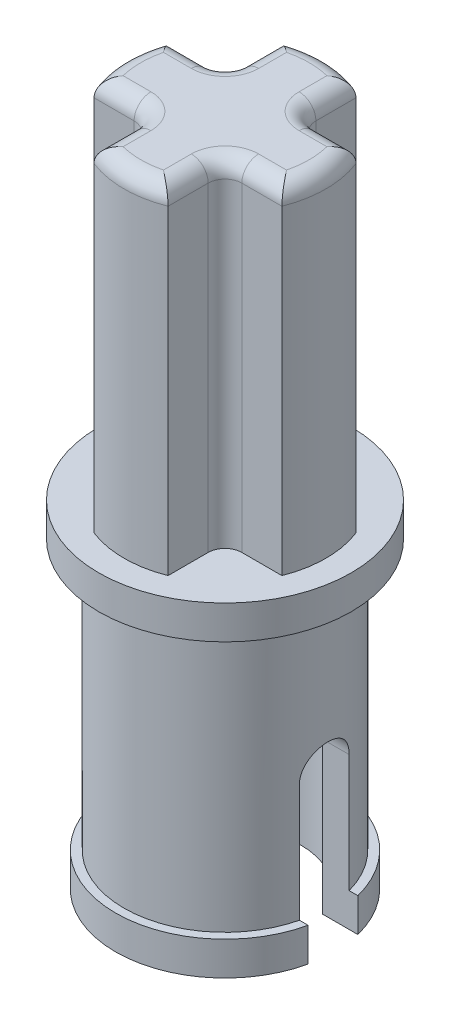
ISO-10303-21;
HEADER;
FILE_DESCRIPTION(('STEP AP214'),'2;1');
FILE_NAME('part.step','',(''),(''),'','','');
FILE_SCHEMA(('AUTOMOTIVE_DESIGN { 1 0 10303 214 1 1 1 1 }'));
ENDSEC;
DATA;
#1=APPLICATION_CONTEXT('core data for automotive mechanical design processes');
#2=APPLICATION_PROTOCOL_DEFINITION('international standard','automotive_design',2000,#1);
#3=PRODUCT_CONTEXT('',#1,'mechanical');
#4=PRODUCT('Part','Part','',(#3));
#5=PRODUCT_RELATED_PRODUCT_CATEGORY('part','',(#4));
#6=PRODUCT_DEFINITION_FORMATION('','',#4);
#7=PRODUCT_DEFINITION_CONTEXT('part definition',#1,'design');
#8=PRODUCT_DEFINITION('design','',#6,#7);
#9=PRODUCT_DEFINITION_SHAPE('','',#8);
#10=(LENGTH_UNIT() NAMED_UNIT(*) SI_UNIT(.MILLI.,.METRE.));
#11=(NAMED_UNIT(*) PLANE_ANGLE_UNIT() SI_UNIT($,.RADIAN.));
#12=(NAMED_UNIT(*) SI_UNIT($,.STERADIAN.) SOLID_ANGLE_UNIT());
#13=UNCERTAINTY_MEASURE_WITH_UNIT(LENGTH_MEASURE(1.E-05),#10,'distance_accuracy_value','');
#14=(GEOMETRIC_REPRESENTATION_CONTEXT(3) GLOBAL_UNCERTAINTY_ASSIGNED_CONTEXT((#13)) GLOBAL_UNIT_ASSIGNED_CONTEXT((#10,
#11,#12)) REPRESENTATION_CONTEXT('',''));
#15=CARTESIAN_POINT('',(0.,0.,0.));
#16=DIRECTION('',(0.,0.,1.));
#17=DIRECTION('',(1.,0.,0.));
#18=AXIS2_PLACEMENT_3D('',#15,#16,#17);
#19=CARTESIAN_POINT('',(0.,-8.001,0.));
#20=DIRECTION('',(0.,1.,0.));
#21=DIRECTION('',(0.,0.,1.));
#22=AXIS2_PLACEMENT_3D('',#19,#20,#21);
#23=CYLINDRICAL_SURFACE('',#22,1.8);
#24=DIRECTION('',(0.,1.,0.));
#25=VECTOR('',#24,1.);
#26=CARTESIAN_POINT('',(1.68389514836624,-8.001,-0.636000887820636));
#27=LINE('',#26,#25);
#28=CARTESIAN_POINT('',(1.68389514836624,-8.,-0.636000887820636));
#29=VERTEX_POINT('',#28);
#30=CARTESIAN_POINT('',(1.68389514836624,-4.4,-0.636000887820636));
#31=VERTEX_POINT('',#30);
#32=EDGE_CURVE('E438',#29,#31,#27,.T.);
#33=ORIENTED_EDGE('',*,*,#32,.T.);
#34=CARTESIAN_POINT('',(1.68389514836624,-4.4,-0.636000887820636));
#35=CARTESIAN_POINT('',(1.68385552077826,-4.36739781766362,-0.636034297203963));
#36=CARTESIAN_POINT('',(1.68489783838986,-4.33482871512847,-0.633346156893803));
#37=CARTESIAN_POINT('',(1.68883756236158,-4.27075833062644,-0.622802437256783));
#38=CARTESIAN_POINT('',(1.69172887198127,-4.23925389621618,-0.614963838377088));
#39=CARTESIAN_POINT('',(1.69905907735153,-4.17810905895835,-0.594398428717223));
#40=CARTESIAN_POINT('',(1.70349695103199,-4.14846744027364,-0.58167484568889));
#41=CARTESIAN_POINT('',(1.71342556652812,-4.09171855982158,-0.551744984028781));
#42=CARTESIAN_POINT('',(1.71891703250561,-4.06461306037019,-0.534535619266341));
#43=CARTESIAN_POINT('',(1.73063042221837,-4.0125461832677,-0.495329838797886));
#44=CARTESIAN_POINT('',(1.73687258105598,-3.98771107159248,-0.473171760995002));
#45=CARTESIAN_POINT('',(1.74927182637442,-3.94202156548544,-0.425047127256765));
#46=CARTESIAN_POINT('',(1.75542889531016,-3.92116798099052,-0.399079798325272));
#47=CARTESIAN_POINT('',(1.76724978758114,-3.88336804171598,-0.343035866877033));
#48=CARTESIAN_POINT('',(1.77289079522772,-3.8665723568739,-0.312852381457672));
#49=CARTESIAN_POINT('',(1.78285715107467,-3.83835082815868,-0.249870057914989));
#50=CARTESIAN_POINT('',(1.78718287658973,-3.82692344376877,-0.21707197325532));
#51=CARTESIAN_POINT('',(1.79395741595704,-3.81015903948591,-0.150943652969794));
#52=CARTESIAN_POINT('',(1.79646413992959,-3.80463119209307,-0.117667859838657));
#53=CARTESIAN_POINT('',(1.79960232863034,-3.79923441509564,-0.0505758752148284));
#54=CARTESIAN_POINT('',(1.80023430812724,-3.79936393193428,-0.0167598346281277));
#55=CARTESIAN_POINT('',(1.79962272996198,-3.80516046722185,0.0488743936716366));
#56=CARTESIAN_POINT('',(1.79846017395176,-3.81058449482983,0.0807151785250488));
#57=CARTESIAN_POINT('',(1.79458032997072,-3.82642954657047,0.14302560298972));
#58=CARTESIAN_POINT('',(1.79186299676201,-3.83685071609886,0.17349520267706));
#59=CARTESIAN_POINT('',(1.78517289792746,-3.86244953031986,0.232478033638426));
#60=CARTESIAN_POINT('',(1.78119111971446,-3.87766131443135,0.260975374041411));
#61=CARTESIAN_POINT('',(1.77242050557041,-3.91237990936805,0.315084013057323));
#62=CARTESIAN_POINT('',(1.76763146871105,-3.93188778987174,0.340694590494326));
#63=CARTESIAN_POINT('',(1.75753681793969,-3.97565671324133,0.389503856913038));
#64=CARTESIAN_POINT('',(1.75221771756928,-4.00009005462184,0.412545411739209));
#65=CARTESIAN_POINT('',(1.74186738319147,-4.05249981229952,0.454270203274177));
#66=CARTESIAN_POINT('',(1.73683624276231,-4.08047737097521,0.472952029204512));
#67=CARTESIAN_POINT('',(1.72758322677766,-4.13979332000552,0.505719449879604));
#68=CARTESIAN_POINT('',(1.72337718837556,-4.17118228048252,0.51971817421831));
#69=CARTESIAN_POINT('',(1.71644727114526,-4.23601710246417,0.542170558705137));
#70=CARTESIAN_POINT('',(1.71372120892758,-4.26945985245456,0.550632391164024));
#71=CARTESIAN_POINT('',(1.71107460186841,-4.31935320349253,0.558775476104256));
#72=CARTESIAN_POINT('',(1.71043284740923,-4.33542364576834,0.560733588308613));
#73=CARTESIAN_POINT('',(1.70957421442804,-4.36765989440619,0.563344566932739));
#74=CARTESIAN_POINT('',(1.70935677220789,-4.38382554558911,0.56399916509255));
#75=CARTESIAN_POINT('',(1.70935806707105,-4.4,0.563999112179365));
#76=B_SPLINE_CURVE_WITH_KNOTS('',3,(#34,#35,#36,#37,#38,#39,#40,#41,#42,#43,#44,#45,#46,#47,#48,
#49,#50,#51,#52,#53,#54,#55,#56,#57,#58,#59,#60,#61,#62,#63,#64,#65,#66,#67,#68,#69,#70,#71,#72,
#73,#74,#75),.UNSPECIFIED.,.F.,.F.,(4,2,2,2,2,2,2,2,2,2,2,2,2,2,2,2,2,2,2,2,4),(0.,
0.0976276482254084,0.194935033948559,0.292178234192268,0.389488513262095,0.490626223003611,
0.591784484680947,0.696262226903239,0.800709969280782,0.901666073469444,1.00259445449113,
1.09909853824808,1.19560543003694,1.29281624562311,1.39005129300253,1.49159441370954,
1.593170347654,1.69653768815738,1.7997521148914,1.84830806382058,1.89679946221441),.UNSPECIFIED.);
#77=CARTESIAN_POINT('',(1.70935806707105,-4.4,0.563999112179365));
#78=VERTEX_POINT('',#77);
#79=EDGE_CURVE('E429',#31,#78,#76,.T.);
#80=ORIENTED_EDGE('',*,*,#79,.T.);
#81=DIRECTION('',(0.,1.,0.));
#82=VECTOR('',#81,1.);
#83=CARTESIAN_POINT('',(1.70935806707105,-8.001,0.563999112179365));
#84=LINE('',#83,#82);
#85=CARTESIAN_POINT('',(1.70935806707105,-8.,0.563999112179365));
#86=VERTEX_POINT('',#85);
#87=EDGE_CURVE('E471',#78,#86,#84,.F.);
#88=ORIENTED_EDGE('',*,*,#87,.T.);
#89=CARTESIAN_POINT('',(0.,-8.,0.));
#90=DIRECTION('',(0.,1.,0.));
#91=DIRECTION('',(0.,0.,1.));
#92=AXIS2_PLACEMENT_3D('',#89,#90,#91);
#93=CIRCLE('',#92,1.8);
#94=CARTESIAN_POINT('',(-1.70935806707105,-8.,0.563999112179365));
#95=VERTEX_POINT('',#94);
#96=EDGE_CURVE('E481',#86,#95,#93,.F.);
#97=ORIENTED_EDGE('',*,*,#96,.T.);
#98=DIRECTION('',(0.,1.,0.));
#99=VECTOR('',#98,1.);
#100=CARTESIAN_POINT('',(-1.70935806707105,-8.001,0.563999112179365));
#101=LINE('',#100,#99);
#102=CARTESIAN_POINT('',(-1.70935806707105,-4.4,0.563999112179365));
#103=VERTEX_POINT('',#102);
#104=EDGE_CURVE('E384',#103,#95,#101,.F.);
#105=ORIENTED_EDGE('',*,*,#104,.F.);
#106=CARTESIAN_POINT('',(-1.68389514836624,-4.4,-0.636000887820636));
#107=CARTESIAN_POINT('',(-1.68385552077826,-4.36739781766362,-0.636034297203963));
#108=CARTESIAN_POINT('',(-1.68489783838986,-4.33482871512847,-0.633346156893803));
#109=CARTESIAN_POINT('',(-1.68883756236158,-4.27075833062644,-0.622802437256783));
#110=CARTESIAN_POINT('',(-1.69172887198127,-4.23925389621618,-0.614963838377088));
#111=CARTESIAN_POINT('',(-1.69905907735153,-4.17810905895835,-0.594398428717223));
#112=CARTESIAN_POINT('',(-1.70349695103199,-4.14846744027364,-0.58167484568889));
#113=CARTESIAN_POINT('',(-1.71342556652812,-4.09171855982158,-0.551744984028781));
#114=CARTESIAN_POINT('',(-1.71891703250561,-4.06461306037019,-0.534535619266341));
#115=CARTESIAN_POINT('',(-1.73063042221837,-4.0125461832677,-0.495329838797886));
#116=CARTESIAN_POINT('',(-1.73687258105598,-3.98771107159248,-0.473171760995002));
#117=CARTESIAN_POINT('',(-1.74927182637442,-3.94202156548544,-0.425047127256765));
#118=CARTESIAN_POINT('',(-1.75542889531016,-3.92116798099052,-0.399079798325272));
#119=CARTESIAN_POINT('',(-1.76724978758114,-3.88336804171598,-0.343035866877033));
#120=CARTESIAN_POINT('',(-1.77289079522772,-3.8665723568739,-0.312852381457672));
#121=CARTESIAN_POINT('',(-1.78285715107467,-3.83835082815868,-0.249870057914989));
#122=CARTESIAN_POINT('',(-1.78718287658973,-3.82692344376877,-0.21707197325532));
#123=CARTESIAN_POINT('',(-1.79395741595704,-3.81015903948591,-0.150943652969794));
#124=CARTESIAN_POINT('',(-1.79646413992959,-3.80463119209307,-0.117667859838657));
#125=CARTESIAN_POINT('',(-1.79960232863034,-3.79923441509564,-0.0505758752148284));
#126=CARTESIAN_POINT('',(-1.80023430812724,-3.79936393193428,-0.0167598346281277));
#127=CARTESIAN_POINT('',(-1.79962272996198,-3.80516046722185,0.0488743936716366));
#128=CARTESIAN_POINT('',(-1.79846017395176,-3.81058449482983,0.0807151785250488));
#129=CARTESIAN_POINT('',(-1.79458032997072,-3.82642954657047,0.14302560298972));
#130=CARTESIAN_POINT('',(-1.79186299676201,-3.83685071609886,0.17349520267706));
#131=CARTESIAN_POINT('',(-1.78517289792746,-3.86244953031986,0.232478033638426));
#132=CARTESIAN_POINT('',(-1.78119111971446,-3.87766131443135,0.260975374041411));
#133=CARTESIAN_POINT('',(-1.77242050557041,-3.91237990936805,0.315084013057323));
#134=CARTESIAN_POINT('',(-1.76763146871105,-3.93188778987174,0.340694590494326));
#135=CARTESIAN_POINT('',(-1.75753681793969,-3.97565671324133,0.389503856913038));
#136=CARTESIAN_POINT('',(-1.75221771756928,-4.00009005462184,0.412545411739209));
#137=CARTESIAN_POINT('',(-1.74186738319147,-4.05249981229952,0.454270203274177));
#138=CARTESIAN_POINT('',(-1.73683624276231,-4.08047737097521,0.472952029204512));
#139=CARTESIAN_POINT('',(-1.72758322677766,-4.13979332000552,0.505719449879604));
#140=CARTESIAN_POINT('',(-1.72337718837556,-4.17118228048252,0.51971817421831));
#141=CARTESIAN_POINT('',(-1.71644727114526,-4.23601710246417,0.542170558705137));
#142=CARTESIAN_POINT('',(-1.71372120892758,-4.26945985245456,0.550632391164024));
#143=CARTESIAN_POINT('',(-1.71107460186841,-4.31935320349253,0.558775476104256));
#144=CARTESIAN_POINT('',(-1.71043284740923,-4.33542364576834,0.560733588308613));
#145=CARTESIAN_POINT('',(-1.70957421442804,-4.36765989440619,0.563344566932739));
#146=CARTESIAN_POINT('',(-1.70935677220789,-4.38382554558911,0.56399916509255));
#147=CARTESIAN_POINT('',(-1.70935806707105,-4.4,0.563999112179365));
#148=B_SPLINE_CURVE_WITH_KNOTS('',3,(#106,#107,#108,#109,#110,#111,#112,#113,#114,#115,#116,
#117,#118,#119,#120,#121,#122,#123,#124,#125,#126,#127,#128,#129,#130,#131,#132,#133,#134,#135,
#136,#137,#138,#139,#140,#141,#142,#143,#144,#145,#146,#147),.UNSPECIFIED.,.F.,.F.,(4,2,2,2,2,2,
2,2,2,2,2,2,2,2,2,2,2,2,2,2,4),(0.,0.0976276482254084,0.194935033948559,0.292178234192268,
0.389488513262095,0.490626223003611,0.591784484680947,0.696262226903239,0.800709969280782,
0.901666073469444,1.00259445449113,1.09909853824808,1.19560543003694,1.29281624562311,
1.39005129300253,1.49159441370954,1.593170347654,1.69653768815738,1.7997521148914,
1.84830806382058,1.89679946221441),.UNSPECIFIED.);
#149=CARTESIAN_POINT('',(-1.68389514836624,-4.4,-0.636000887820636));
#150=VERTEX_POINT('',#149);
#151=EDGE_CURVE('E375',#150,#103,#148,.T.);
#152=ORIENTED_EDGE('',*,*,#151,.F.);
#153=DIRECTION('',(0.,1.,0.));
#154=VECTOR('',#153,1.);
#155=CARTESIAN_POINT('',(-1.68389514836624,-8.001,-0.636000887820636));
#156=LINE('',#155,#154);
#157=CARTESIAN_POINT('',(-1.68389514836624,-8.,-0.636000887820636));
#158=VERTEX_POINT('',#157);
#159=EDGE_CURVE('E413',#158,#150,#156,.T.);
#160=ORIENTED_EDGE('',*,*,#159,.F.);
#161=EDGE_CURVE('E484',#158,#29,#93,.F.);
#162=ORIENTED_EDGE('',*,*,#161,.T.);
#163=EDGE_LOOP('',(#33,#80,#88,#97,#105,#152,#160,#162));
#164=FACE_BOUND('',#163,.T.);
#165=CARTESIAN_POINT('',(0.,-0.8,0.));
#166=DIRECTION('',(0.,1.,0.));
#167=DIRECTION('',(0.,0.,1.));
#168=AXIS2_PLACEMENT_3D('',#165,#166,#167);
#169=CIRCLE('',#168,1.8);
#170=CARTESIAN_POINT('',(0.,-0.8,1.8));
#171=VERTEX_POINT('',#170);
#172=EDGE_CURVE('E368',#171,#171,#169,.F.);
#173=ORIENTED_EDGE('',*,*,#172,.F.);
#174=EDGE_LOOP('',(#173));
#175=FACE_BOUND('',#174,.T.);
#176=ADVANCED_FACE('F38',(#164,#175),#23,.F.);
#177=CARTESIAN_POINT('',(0.,-0.8,0.));
#178=DIRECTION('',(0.,1.,0.));
#179=DIRECTION('',(0.,0.,1.));
#180=AXIS2_PLACEMENT_3D('',#177,#178,#179);
#181=CYLINDRICAL_SURFACE('',#180,3.);
#182=CARTESIAN_POINT('',(0.,-0.8,0.));
#183=DIRECTION('',(0.,1.,0.));
#184=DIRECTION('',(0.,0.,1.));
#185=AXIS2_PLACEMENT_3D('',#182,#183,#184);
#186=CIRCLE('',#185,3.);
#187=CARTESIAN_POINT('',(0.,-0.8,3.));
#188=VERTEX_POINT('',#187);
#189=EDGE_CURVE('E493',#188,#188,#186,.T.);
#190=ORIENTED_EDGE('',*,*,#189,.T.);
#191=EDGE_LOOP('',(#190));
#192=FACE_BOUND('',#191,.T.);
#193=CARTESIAN_POINT('',(0.,0.,0.));
#194=DIRECTION('',(0.,1.,0.));
#195=DIRECTION('',(0.,0.,1.));
#196=AXIS2_PLACEMENT_3D('',#193,#194,#195);
#197=CIRCLE('',#196,3.);
#198=CARTESIAN_POINT('',(0.,0.,3.));
#199=VERTEX_POINT('',#198);
#200=EDGE_CURVE('E367',#199,#199,#197,.T.);
#201=ORIENTED_EDGE('',*,*,#200,.F.);
#202=EDGE_LOOP('',(#201));
#203=FACE_BOUND('',#202,.T.);
#204=ADVANCED_FACE('F691',(#192,#203),#181,.T.);
#205=CARTESIAN_POINT('',(0.,-8.,0.));
#206=DIRECTION('',(0.,1.,0.));
#207=DIRECTION('',(0.,0.,1.));
#208=AXIS2_PLACEMENT_3D('',#205,#206,#207);
#209=CYLINDRICAL_SURFACE('',#208,2.4);
#210=CARTESIAN_POINT('',(0.,-0.8,0.));
#211=DIRECTION('',(0.,1.,0.));
#212=DIRECTION('',(0.,0.,1.));
#213=AXIS2_PLACEMENT_3D('',#210,#211,#212);
#214=CIRCLE('',#213,2.4);
#215=CARTESIAN_POINT('',(0.,-0.8,2.4));
#216=VERTEX_POINT('',#215);
#217=EDGE_CURVE('E372',#216,#216,#214,.F.);
#218=ORIENTED_EDGE('',*,*,#217,.T.);
#219=EDGE_LOOP('',(#218));
#220=FACE_BOUND('',#219,.T.);
#221=CARTESIAN_POINT('',(2.31419594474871,-4.4,-0.636000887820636));
#222=CARTESIAN_POINT('',(2.31416705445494,-4.36688854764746,-0.636032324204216));
#223=CARTESIAN_POINT('',(2.31494846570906,-4.33379907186,-0.633262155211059));
#224=CARTESIAN_POINT('',(2.31791197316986,-4.26864897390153,-0.622366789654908));
#225=CARTESIAN_POINT('',(2.32009102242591,-4.23658627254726,-0.614253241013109));
#226=CARTESIAN_POINT('',(2.32563122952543,-4.17432752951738,-0.59291897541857));
#227=CARTESIAN_POINT('',(2.32899220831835,-4.14413120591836,-0.579699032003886));
#228=CARTESIAN_POINT('',(2.3365233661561,-4.08637395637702,-0.548558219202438));
#229=CARTESIAN_POINT('',(2.34069379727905,-4.05881385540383,-0.530635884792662));
#230=CARTESIAN_POINT('',(2.34951148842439,-4.00645048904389,-0.490135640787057));
#231=CARTESIAN_POINT('',(2.35416719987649,-3.98172093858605,-0.467464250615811));
#232=CARTESIAN_POINT('',(2.36339577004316,-3.93636577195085,-0.418312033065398));
#233=CARTESIAN_POINT('',(2.36796861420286,-3.91574087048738,-0.391830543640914));
#234=CARTESIAN_POINT('',(2.37664547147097,-3.87883383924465,-0.335243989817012));
#235=CARTESIAN_POINT('',(2.38073987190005,-3.86263408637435,-0.305083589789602));
#236=CARTESIAN_POINT('',(2.38794093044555,-3.83556525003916,-0.242349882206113));
#237=CARTESIAN_POINT('',(2.39104777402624,-3.8246951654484,-0.209777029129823));
#238=CARTESIAN_POINT('',(2.39591106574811,-3.80881058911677,-0.143812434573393));
#239=CARTESIAN_POINT('',(2.39769273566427,-3.80368573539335,-0.110449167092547));
#240=CARTESIAN_POINT('',(2.39984451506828,-3.79910138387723,-0.0432919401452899));
#241=CARTESIAN_POINT('',(2.40021482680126,-3.79964107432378,-0.00949804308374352));
#242=CARTESIAN_POINT('',(2.39955343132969,-3.8062910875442,0.0566712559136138));
#243=CARTESIAN_POINT('',(2.39855627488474,-3.81226289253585,0.0890610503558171));
#244=CARTESIAN_POINT('',(2.39536789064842,-3.82939472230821,0.152374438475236));
#245=CARTESIAN_POINT('',(2.39317663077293,-3.84055488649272,0.183297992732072));
#246=CARTESIAN_POINT('',(2.38785428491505,-3.86780338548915,0.243015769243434));
#247=CARTESIAN_POINT('',(2.384717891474,-3.88391956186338,0.271796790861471));
#248=CARTESIAN_POINT('',(2.37787482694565,-3.92060156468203,0.326292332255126));
#249=CARTESIAN_POINT('',(2.37416807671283,-3.94116800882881,0.352006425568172));
#250=CARTESIAN_POINT('',(2.36650518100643,-3.98678891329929,0.400334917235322));
#251=CARTESIAN_POINT('',(2.36254507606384,-4.01194503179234,0.422852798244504));
#252=CARTESIAN_POINT('',(2.35493151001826,-4.06571161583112,0.463383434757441));
#253=CARTESIAN_POINT('',(2.35127813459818,-4.09432304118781,0.481394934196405));
#254=CARTESIAN_POINT('',(2.34469483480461,-4.15444857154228,0.51250541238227));
#255=CARTESIAN_POINT('',(2.34177041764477,-4.1859824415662,0.525567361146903));
#256=CARTESIAN_POINT('',(2.337053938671,-4.25086419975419,0.546161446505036));
#257=CARTESIAN_POINT('',(2.3352602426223,-4.28420939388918,0.553701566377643));
#258=CARTESIAN_POINT('',(2.33369548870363,-4.33153564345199,0.560239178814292));
#259=CARTESIAN_POINT('',(2.33335616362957,-4.34519974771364,0.561649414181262));
#260=CARTESIAN_POINT('',(2.33290305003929,-4.37257374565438,0.563528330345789));
#261=CARTESIAN_POINT('',(2.332788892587,-4.38628352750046,0.563998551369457));
#262=CARTESIAN_POINT('',(2.33278910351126,-4.4,0.563999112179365));
#263=B_SPLINE_CURVE_WITH_KNOTS('',3,(#221,#222,#223,#224,#225,#226,#227,#228,#229,#230,#231,
#232,#233,#234,#235,#236,#237,#238,#239,#240,#241,#242,#243,#244,#245,#246,#247,#248,#249,#250,
#251,#252,#253,#254,#255,#256,#257,#258,#259,#260,#261,#262),.UNSPECIFIED.,.F.,.F.,(4,2,2,2,2,2,
2,2,2,2,2,2,2,2,2,2,2,2,2,2,4),(0.,0.0991756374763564,0.198135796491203,0.297080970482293,
0.396057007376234,0.497203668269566,0.59836792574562,0.701303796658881,0.804220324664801,
0.905124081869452,1.00601337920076,1.10440000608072,1.20278927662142,1.30174169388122,
1.40070785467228,1.50221456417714,1.60374953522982,1.70602980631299,1.80816191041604,
1.84935705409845,1.89048464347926),.UNSPECIFIED.);
#264=CARTESIAN_POINT('',(2.31419594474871,-4.4,-0.636000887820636));
#265=VERTEX_POINT('',#264);
#266=CARTESIAN_POINT('',(2.33278910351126,-4.4,0.563999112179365));
#267=VERTEX_POINT('',#266);
#268=EDGE_CURVE('E450',#265,#267,#263,.T.);
#269=ORIENTED_EDGE('',*,*,#268,.F.);
#270=DIRECTION('',(0.,1.,0.));
#271=VECTOR('',#270,1.);
#272=CARTESIAN_POINT('',(2.31419594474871,-8.,-0.636000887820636));
#273=LINE('',#272,#271);
#274=CARTESIAN_POINT('',(2.31419594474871,-7.2,-0.636000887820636));
#275=VERTEX_POINT('',#274);
#276=EDGE_CURVE('E457',#275,#265,#273,.T.);
#277=ORIENTED_EDGE('',*,*,#276,.F.);
#278=CARTESIAN_POINT('',(0.,-7.2,0.));
#279=DIRECTION('',(0.,-1.,0.));
#280=DIRECTION('',(0.,0.,-1.));
#281=AXIS2_PLACEMENT_3D('',#278,#279,#280);
#282=CIRCLE('',#281,2.4);
#283=CARTESIAN_POINT('',(-2.31419594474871,-7.2,-0.636000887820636));
#284=VERTEX_POINT('',#283);
#285=EDGE_CURVE('E499',#275,#284,#282,.F.);
#286=ORIENTED_EDGE('',*,*,#285,.T.);
#287=DIRECTION('',(0.,1.,0.));
#288=VECTOR('',#287,1.);
#289=CARTESIAN_POINT('',(-2.31419594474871,-8.,-0.636000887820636));
#290=LINE('',#289,#288);
#291=CARTESIAN_POINT('',(-2.31419594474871,-4.4,-0.636000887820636));
#292=VERTEX_POINT('',#291);
#293=EDGE_CURVE('E426',#284,#292,#290,.T.);
#294=ORIENTED_EDGE('',*,*,#293,.T.);
#295=CARTESIAN_POINT('',(-2.31419594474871,-4.4,-0.636000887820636));
#296=CARTESIAN_POINT('',(-2.31416705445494,-4.36688854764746,-0.636032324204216));
#297=CARTESIAN_POINT('',(-2.31494846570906,-4.33379907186,-0.633262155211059));
#298=CARTESIAN_POINT('',(-2.31791197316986,-4.26864897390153,-0.622366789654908));
#299=CARTESIAN_POINT('',(-2.32009102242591,-4.23658627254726,-0.614253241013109));
#300=CARTESIAN_POINT('',(-2.32563122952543,-4.17432752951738,-0.59291897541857));
#301=CARTESIAN_POINT('',(-2.32899220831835,-4.14413120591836,-0.579699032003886));
#302=CARTESIAN_POINT('',(-2.3365233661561,-4.08637395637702,-0.548558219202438));
#303=CARTESIAN_POINT('',(-2.34069379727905,-4.05881385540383,-0.530635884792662));
#304=CARTESIAN_POINT('',(-2.34951148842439,-4.00645048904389,-0.490135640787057));
#305=CARTESIAN_POINT('',(-2.35416719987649,-3.98172093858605,-0.467464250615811));
#306=CARTESIAN_POINT('',(-2.36339577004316,-3.93636577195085,-0.418312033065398));
#307=CARTESIAN_POINT('',(-2.36796861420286,-3.91574087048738,-0.391830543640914));
#308=CARTESIAN_POINT('',(-2.37664547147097,-3.87883383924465,-0.335243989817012));
#309=CARTESIAN_POINT('',(-2.38073987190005,-3.86263408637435,-0.305083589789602));
#310=CARTESIAN_POINT('',(-2.38794093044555,-3.83556525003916,-0.242349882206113));
#311=CARTESIAN_POINT('',(-2.39104777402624,-3.8246951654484,-0.209777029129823));
#312=CARTESIAN_POINT('',(-2.39591106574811,-3.80881058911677,-0.143812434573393));
#313=CARTESIAN_POINT('',(-2.39769273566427,-3.80368573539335,-0.110449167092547));
#314=CARTESIAN_POINT('',(-2.39984451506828,-3.79910138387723,-0.0432919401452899));
#315=CARTESIAN_POINT('',(-2.40021482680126,-3.79964107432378,-0.00949804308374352));
#316=CARTESIAN_POINT('',(-2.39955343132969,-3.8062910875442,0.0566712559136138));
#317=CARTESIAN_POINT('',(-2.39855627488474,-3.81226289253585,0.0890610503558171));
#318=CARTESIAN_POINT('',(-2.39536789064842,-3.82939472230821,0.152374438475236));
#319=CARTESIAN_POINT('',(-2.39317663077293,-3.84055488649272,0.183297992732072));
#320=CARTESIAN_POINT('',(-2.38785428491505,-3.86780338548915,0.243015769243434));
#321=CARTESIAN_POINT('',(-2.384717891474,-3.88391956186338,0.271796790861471));
#322=CARTESIAN_POINT('',(-2.37787482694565,-3.92060156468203,0.326292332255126));
#323=CARTESIAN_POINT('',(-2.37416807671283,-3.94116800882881,0.352006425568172));
#324=CARTESIAN_POINT('',(-2.36650518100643,-3.98678891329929,0.400334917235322));
#325=CARTESIAN_POINT('',(-2.36254507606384,-4.01194503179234,0.422852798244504));
#326=CARTESIAN_POINT('',(-2.35493151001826,-4.06571161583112,0.463383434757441));
#327=CARTESIAN_POINT('',(-2.35127813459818,-4.09432304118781,0.481394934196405));
#328=CARTESIAN_POINT('',(-2.34469483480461,-4.15444857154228,0.51250541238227));
#329=CARTESIAN_POINT('',(-2.34177041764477,-4.1859824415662,0.525567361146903));
#330=CARTESIAN_POINT('',(-2.337053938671,-4.25086419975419,0.546161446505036));
#331=CARTESIAN_POINT('',(-2.3352602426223,-4.28420939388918,0.553701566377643));
#332=CARTESIAN_POINT('',(-2.33369548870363,-4.33153564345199,0.560239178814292));
#333=CARTESIAN_POINT('',(-2.33335616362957,-4.34519974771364,0.561649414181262));
#334=CARTESIAN_POINT('',(-2.33290305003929,-4.37257374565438,0.563528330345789));
#335=CARTESIAN_POINT('',(-2.332788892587,-4.38628352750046,0.563998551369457));
#336=CARTESIAN_POINT('',(-2.33278910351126,-4.4,0.563999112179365));
#337=B_SPLINE_CURVE_WITH_KNOTS('',3,(#295,#296,#297,#298,#299,#300,#301,#302,#303,#304,#305,
#306,#307,#308,#309,#310,#311,#312,#313,#314,#315,#316,#317,#318,#319,#320,#321,#322,#323,#324,
#325,#326,#327,#328,#329,#330,#331,#332,#333,#334,#335,#336),.UNSPECIFIED.,.F.,.F.,(4,2,2,2,2,2,
2,2,2,2,2,2,2,2,2,2,2,2,2,2,4),(0.,0.0991756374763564,0.198135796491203,0.297080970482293,
0.396057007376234,0.497203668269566,0.59836792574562,0.701303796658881,0.804220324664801,
0.905124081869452,1.00601337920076,1.10440000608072,1.20278927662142,1.30174169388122,
1.40070785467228,1.50221456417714,1.60374953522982,1.70602980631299,1.80816191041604,
1.84935705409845,1.89048464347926),.UNSPECIFIED.);
#338=CARTESIAN_POINT('',(-2.33278910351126,-4.4,0.563999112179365));
#339=VERTEX_POINT('',#338);
#340=EDGE_CURVE('E397',#292,#339,#337,.T.);
#341=ORIENTED_EDGE('',*,*,#340,.T.);
#342=DIRECTION('',(0.,1.,0.));
#343=VECTOR('',#342,1.);
#344=CARTESIAN_POINT('',(-2.33278910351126,-8.,0.563999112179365));
#345=LINE('',#344,#343);
#346=CARTESIAN_POINT('',(-2.33278910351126,-7.2,0.563999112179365));
#347=VERTEX_POINT('',#346);
#348=EDGE_CURVE('E405',#339,#347,#345,.F.);
#349=ORIENTED_EDGE('',*,*,#348,.T.);
#350=CARTESIAN_POINT('',(2.33278910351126,-7.2,0.563999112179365));
#351=VERTEX_POINT('',#350);
#352=EDGE_CURVE('E496',#347,#351,#282,.F.);
#353=ORIENTED_EDGE('',*,*,#352,.T.);
#354=DIRECTION('',(0.,1.,0.));
#355=VECTOR('',#354,1.);
#356=CARTESIAN_POINT('',(2.33278910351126,-8.,0.563999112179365));
#357=LINE('',#356,#355);
#358=EDGE_CURVE('E479',#267,#351,#357,.F.);
#359=ORIENTED_EDGE('',*,*,#358,.F.);
#360=EDGE_LOOP('',(#269,#277,#286,#294,#341,#349,#353,#359));
#361=FACE_BOUND('',#360,.T.);
#362=ADVANCED_FACE('F697',(#220,#361),#209,.T.);
#363=CARTESIAN_POINT('',(0.,-7.2,0.));
#364=DIRECTION('',(0.,-1.,0.));
#365=DIRECTION('',(0.,0.,-1.));
#366=AXIS2_PLACEMENT_3D('',#363,#364,#365);
#367=CYLINDRICAL_SURFACE('',#366,2.6);
#368=CARTESIAN_POINT('',(0.,-7.2,0.));
#369=DIRECTION('',(0.,-1.,0.));
#370=DIRECTION('',(0.,0.,-1.));
#371=AXIS2_PLACEMENT_3D('',#368,#369,#370);
#372=CIRCLE('',#371,2.6);
#373=CARTESIAN_POINT('',(-2.52101227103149,-7.2,-0.636000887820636));
#374=VERTEX_POINT('',#373);
#375=CARTESIAN_POINT('',(2.52101227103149,-7.2,-0.636000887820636));
#376=VERTEX_POINT('',#375);
#377=EDGE_CURVE('E485',#374,#376,#372,.T.);
#378=ORIENTED_EDGE('',*,*,#377,.T.);
#379=DIRECTION('',(0.,-1.,0.));
#380=VECTOR('',#379,1.);
#381=CARTESIAN_POINT('',(2.52101227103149,-7.2,-0.636000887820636));
#382=LINE('',#381,#380);
#383=CARTESIAN_POINT('',(2.52101227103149,-8.,-0.636000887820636));
#384=VERTEX_POINT('',#383);
#385=EDGE_CURVE('E458',#384,#376,#382,.F.);
#386=ORIENTED_EDGE('',*,*,#385,.F.);
#387=CARTESIAN_POINT('',(0.,-8.,0.));
#388=DIRECTION('',(0.,-1.,0.));
#389=DIRECTION('',(0.,0.,-1.));
#390=AXIS2_PLACEMENT_3D('',#387,#388,#389);
#391=CIRCLE('',#390,2.6);
#392=CARTESIAN_POINT('',(-2.52101227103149,-8.,-0.636000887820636));
#393=VERTEX_POINT('',#392);
#394=EDGE_CURVE('E490',#393,#384,#391,.T.);
#395=ORIENTED_EDGE('',*,*,#394,.F.);
#396=DIRECTION('',(0.,-1.,0.));
#397=VECTOR('',#396,1.);
#398=CARTESIAN_POINT('',(-2.52101227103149,-7.2,-0.636000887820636));
#399=LINE('',#398,#397);
#400=EDGE_CURVE('E423',#393,#374,#399,.F.);
#401=ORIENTED_EDGE('',*,*,#400,.T.);
#402=EDGE_LOOP('',(#378,#386,#395,#401));
#403=FACE_BOUND('',#402,.T.);
#404=ADVANCED_FACE('F710',(#403),#367,.T.);
#405=CARTESIAN_POINT('',(2.53809081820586,-8.,0.563999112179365));
#406=VERTEX_POINT('',#405);
#407=CARTESIAN_POINT('',(-2.53809081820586,-8.,0.563999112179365));
#408=VERTEX_POINT('',#407);
#409=EDGE_CURVE('E489',#406,#408,#391,.T.);
#410=ORIENTED_EDGE('',*,*,#409,.F.);
#411=DIRECTION('',(0.,-1.,0.));
#412=VECTOR('',#411,1.);
#413=CARTESIAN_POINT('',(2.53809081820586,-7.2,0.563999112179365));
#414=LINE('',#413,#412);
#415=CARTESIAN_POINT('',(2.53809081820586,-7.2,0.563999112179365));
#416=VERTEX_POINT('',#415);
#417=EDGE_CURVE('E477',#416,#406,#414,.T.);
#418=ORIENTED_EDGE('',*,*,#417,.F.);
#419=CARTESIAN_POINT('',(-2.53809081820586,-7.2,0.563999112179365));
#420=VERTEX_POINT('',#419);
#421=EDGE_CURVE('E488',#416,#420,#372,.T.);
#422=ORIENTED_EDGE('',*,*,#421,.T.);
#423=DIRECTION('',(0.,-1.,0.));
#424=VECTOR('',#423,1.);
#425=CARTESIAN_POINT('',(-2.53809081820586,-7.2,0.563999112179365));
#426=LINE('',#425,#424);
#427=EDGE_CURVE('E406',#420,#408,#426,.T.);
#428=ORIENTED_EDGE('',*,*,#427,.T.);
#429=EDGE_LOOP('',(#410,#418,#422,#428));
#430=FACE_BOUND('',#429,.T.);
#431=ADVANCED_FACE('F708',(#430),#367,.T.);
#432=CARTESIAN_POINT('',(0.,-7.2,0.));
#433=DIRECTION('',(0.,-1.,0.));
#434=DIRECTION('',(0.,0.,-1.));
#435=AXIS2_PLACEMENT_3D('',#432,#433,#434);
#436=PLANE('',#435);
#437=DIRECTION('',(1.,0.,0.));
#438=VECTOR('',#437,1.);
#439=CARTESIAN_POINT('',(3.001,-7.2,-0.636000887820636));
#440=LINE('',#439,#438);
#441=EDGE_CURVE('E1336',#275,#376,#440,.T.);
#442=ORIENTED_EDGE('',*,*,#441,.T.);
#443=ORIENTED_EDGE('',*,*,#377,.F.);
#444=DIRECTION('',(-1.,0.,0.));
#445=VECTOR('',#444,1.);
#446=CARTESIAN_POINT('',(-3.001,-7.2,-0.636000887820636));
#447=LINE('',#446,#445);
#448=EDGE_CURVE('E421',#284,#374,#447,.T.);
#449=ORIENTED_EDGE('',*,*,#448,.F.);
#450=ORIENTED_EDGE('',*,*,#285,.F.);
#451=EDGE_LOOP('',(#442,#443,#449,#450));
#452=FACE_BOUND('',#451,.T.);
#453=ADVANCED_FACE('F704',(#452),#436,.F.);
#454=DIRECTION('',(-1.,0.,0.));
#455=VECTOR('',#454,1.);
#456=CARTESIAN_POINT('',(3.001,-7.2,0.563999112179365));
#457=LINE('',#456,#455);
#458=EDGE_CURVE('E474',#416,#351,#457,.T.);
#459=ORIENTED_EDGE('',*,*,#458,.T.);
#460=ORIENTED_EDGE('',*,*,#352,.F.);
#461=DIRECTION('',(1.,0.,0.));
#462=VECTOR('',#461,1.);
#463=CARTESIAN_POINT('',(-3.001,-7.2,0.563999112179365));
#464=LINE('',#463,#462);
#465=EDGE_CURVE('E750',#420,#347,#464,.T.);
#466=ORIENTED_EDGE('',*,*,#465,.F.);
#467=ORIENTED_EDGE('',*,*,#421,.F.);
#468=EDGE_LOOP('',(#459,#460,#466,#467));
#469=FACE_BOUND('',#468,.T.);
#470=ADVANCED_FACE('F707',(#469),#436,.F.);
#471=CARTESIAN_POINT('',(0.,-8.,0.));
#472=DIRECTION('',(0.,1.,0.));
#473=DIRECTION('',(0.,0.,1.));
#474=AXIS2_PLACEMENT_3D('',#471,#472,#473);
#475=PLANE('',#474);
#476=DIRECTION('',(-1.,0.,0.));
#477=VECTOR('',#476,1.);
#478=CARTESIAN_POINT('',(3.001,-8.,-0.636000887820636));
#479=LINE('',#478,#477);
#480=EDGE_CURVE('E468',#384,#29,#479,.T.);
#481=ORIENTED_EDGE('',*,*,#480,.T.);
#482=ORIENTED_EDGE('',*,*,#161,.F.);
#483=DIRECTION('',(1.,0.,0.));
#484=VECTOR('',#483,1.);
#485=CARTESIAN_POINT('',(-3.001,-8.,-0.636000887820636));
#486=LINE('',#485,#484);
#487=EDGE_CURVE('E409',#393,#158,#486,.T.);
#488=ORIENTED_EDGE('',*,*,#487,.F.);
#489=ORIENTED_EDGE('',*,*,#394,.T.);
#490=EDGE_LOOP('',(#481,#482,#488,#489));
#491=FACE_BOUND('',#490,.T.);
#492=ADVANCED_FACE('F719',(#491),#475,.F.);
#493=DIRECTION('',(-1.,0.,0.));
#494=VECTOR('',#493,1.);
#495=CARTESIAN_POINT('',(3.001,-8.,0.563999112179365));
#496=LINE('',#495,#494);
#497=EDGE_CURVE('E460',#406,#86,#496,.T.);
#498=ORIENTED_EDGE('',*,*,#497,.F.);
#499=ORIENTED_EDGE('',*,*,#409,.T.);
#500=DIRECTION('',(1.,0.,0.));
#501=VECTOR('',#500,1.);
#502=CARTESIAN_POINT('',(-3.001,-8.,0.563999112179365));
#503=LINE('',#502,#501);
#504=EDGE_CURVE('E410',#408,#95,#503,.T.);
#505=ORIENTED_EDGE('',*,*,#504,.T.);
#506=ORIENTED_EDGE('',*,*,#96,.F.);
#507=EDGE_LOOP('',(#498,#499,#505,#506));
#508=FACE_BOUND('',#507,.T.);
#509=ADVANCED_FACE('F716',(#508),#475,.F.);
#510=CARTESIAN_POINT('',(0.,-0.8,0.));
#511=DIRECTION('',(0.,1.,0.));
#512=DIRECTION('',(0.,0.,1.));
#513=AXIS2_PLACEMENT_3D('',#510,#511,#512);
#514=PLANE('',#513);
#515=ORIENTED_EDGE('',*,*,#217,.F.);
#516=EDGE_LOOP('',(#515));
#517=FACE_BOUND('',#516,.T.);
#518=ORIENTED_EDGE('',*,*,#189,.F.);
#519=EDGE_LOOP('',(#518));
#520=FACE_BOUND('',#519,.T.);
#521=ADVANCED_FACE('F714',(#517,#520),#514,.F.);
#522=CARTESIAN_POINT('',(-3.001,-8.,0.563999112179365));
#523=DIRECTION('',(0.,0.,1.));
#524=DIRECTION('',(1.,0.,0.));
#525=AXIS2_PLACEMENT_3D('',#522,#523,#524);
#526=PLANE('',#525);
#527=DIRECTION('',(1.,0.,0.));
#528=VECTOR('',#527,1.);
#529=CARTESIAN_POINT('',(-3.001,-4.4,0.563999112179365));
#530=LINE('',#529,#528);
#531=EDGE_CURVE('E414',#339,#103,#530,.T.);
#532=ORIENTED_EDGE('',*,*,#531,.T.);
#533=ORIENTED_EDGE('',*,*,#104,.T.);
#534=ORIENTED_EDGE('',*,*,#504,.F.);
#535=ORIENTED_EDGE('',*,*,#427,.F.);
#536=ORIENTED_EDGE('',*,*,#465,.T.);
#537=ORIENTED_EDGE('',*,*,#348,.F.);
#538=EDGE_LOOP('',(#532,#533,#534,#535,#536,#537));
#539=FACE_BOUND('',#538,.T.);
#540=ADVANCED_FACE('F395',(#539),#526,.F.);
#541=CARTESIAN_POINT('',(-3.001,-4.4,-0.0360008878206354));
#542=DIRECTION('',(1.,0.,0.));
#543=DIRECTION('',(0.,0.,-1.));
#544=AXIS2_PLACEMENT_3D('',#541,#542,#543);
#545=CYLINDRICAL_SURFACE('',#544,0.600000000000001);
#546=DIRECTION('',(1.,0.,0.));
#547=VECTOR('',#546,1.);
#548=CARTESIAN_POINT('',(-3.001,-4.4,-0.636000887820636));
#549=LINE('',#548,#547);
#550=EDGE_CURVE('E416',#292,#150,#549,.T.);
#551=ORIENTED_EDGE('',*,*,#550,.T.);
#552=ORIENTED_EDGE('',*,*,#151,.T.);
#553=ORIENTED_EDGE('',*,*,#531,.F.);
#554=ORIENTED_EDGE('',*,*,#340,.F.);
#555=EDGE_LOOP('',(#551,#552,#553,#554));
#556=FACE_BOUND('',#555,.T.);
#557=ADVANCED_FACE('F386',(#556),#545,.F.);
#558=CARTESIAN_POINT('',(-3.001,-8.,-0.636000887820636));
#559=DIRECTION('',(0.,0.,-1.));
#560=DIRECTION('',(-1.,0.,0.));
#561=AXIS2_PLACEMENT_3D('',#558,#559,#560);
#562=PLANE('',#561);
#563=ORIENTED_EDGE('',*,*,#448,.T.);
#564=ORIENTED_EDGE('',*,*,#400,.F.);
#565=ORIENTED_EDGE('',*,*,#487,.T.);
#566=ORIENTED_EDGE('',*,*,#159,.T.);
#567=ORIENTED_EDGE('',*,*,#550,.F.);
#568=ORIENTED_EDGE('',*,*,#293,.F.);
#569=EDGE_LOOP('',(#563,#564,#565,#566,#567,#568));
#570=FACE_BOUND('',#569,.T.);
#571=ADVANCED_FACE('F446',(#570),#562,.F.);
#572=CARTESIAN_POINT('',(3.001,-8.,-0.636000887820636));
#573=DIRECTION('',(0.,0.,1.));
#574=DIRECTION('',(1.,0.,0.));
#575=AXIS2_PLACEMENT_3D('',#572,#573,#574);
#576=PLANE('',#575);
#577=ORIENTED_EDGE('',*,*,#276,.T.);
#578=DIRECTION('',(-1.,0.,0.));
#579=VECTOR('',#578,1.);
#580=CARTESIAN_POINT('',(3.001,-4.4,-0.636000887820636));
#581=LINE('',#580,#579);
#582=EDGE_CURVE('E465',#265,#31,#581,.T.);
#583=ORIENTED_EDGE('',*,*,#582,.T.);
#584=ORIENTED_EDGE('',*,*,#32,.F.);
#585=ORIENTED_EDGE('',*,*,#480,.F.);
#586=ORIENTED_EDGE('',*,*,#385,.T.);
#587=ORIENTED_EDGE('',*,*,#441,.F.);
#588=EDGE_LOOP('',(#577,#583,#584,#585,#586,#587));
#589=FACE_BOUND('',#588,.T.);
#590=ADVANCED_FACE('F703',(#589),#576,.T.);
#591=CARTESIAN_POINT('',(3.001,-4.4,-0.0360008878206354));
#592=DIRECTION('',(-1.,0.,0.));
#593=DIRECTION('',(0.,0.,1.));
#594=AXIS2_PLACEMENT_3D('',#591,#592,#593);
#595=CYLINDRICAL_SURFACE('',#594,0.600000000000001);
#596=ORIENTED_EDGE('',*,*,#268,.T.);
#597=DIRECTION('',(-1.,0.,0.));
#598=VECTOR('',#597,1.);
#599=CARTESIAN_POINT('',(3.001,-4.4,0.563999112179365));
#600=LINE('',#599,#598);
#601=EDGE_CURVE('E462',#267,#78,#600,.T.);
#602=ORIENTED_EDGE('',*,*,#601,.T.);
#603=ORIENTED_EDGE('',*,*,#79,.F.);
#604=ORIENTED_EDGE('',*,*,#582,.F.);
#605=EDGE_LOOP('',(#596,#602,#603,#604));
#606=FACE_BOUND('',#605,.T.);
#607=ADVANCED_FACE('F440',(#606),#595,.F.);
#608=CARTESIAN_POINT('',(3.001,-8.,0.563999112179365));
#609=DIRECTION('',(0.,0.,-1.));
#610=DIRECTION('',(-1.,0.,0.));
#611=AXIS2_PLACEMENT_3D('',#608,#609,#610);
#612=PLANE('',#611);
#613=ORIENTED_EDGE('',*,*,#358,.T.);
#614=ORIENTED_EDGE('',*,*,#458,.F.);
#615=ORIENTED_EDGE('',*,*,#417,.T.);
#616=ORIENTED_EDGE('',*,*,#497,.T.);
#617=ORIENTED_EDGE('',*,*,#87,.F.);
#618=ORIENTED_EDGE('',*,*,#601,.F.);
#619=EDGE_LOOP('',(#613,#614,#615,#616,#617,#618));
#620=FACE_BOUND('',#619,.T.);
#621=ADVANCED_FACE('F448',(#620),#612,.T.);
#622=CARTESIAN_POINT('',(0.,0.,0.));
#623=DIRECTION('',(0.,1.,0.));
#624=DIRECTION('',(0.,0.,1.));
#625=AXIS2_PLACEMENT_3D('',#622,#623,#624);
#626=PLANE('',#625);
#627=CARTESIAN_POINT('',(0.,0.,0.));
#628=DIRECTION('',(0.,1.,0.));
#629=DIRECTION('',(0.,0.,1.));
#630=AXIS2_PLACEMENT_3D('',#627,#628,#629);
#631=CIRCLE('',#630,2.4);
#632=CARTESIAN_POINT('',(-0.88,0.,2.23284571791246));
#633=VERTEX_POINT('',#632);
#634=CARTESIAN_POINT('',(0.88,0.,2.23284571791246));
#635=VERTEX_POINT('',#634);
#636=EDGE_CURVE('E298',#633,#635,#631,.T.);
#637=ORIENTED_EDGE('',*,*,#636,.F.);
#638=DIRECTION('',(0.,0.,1.));
#639=VECTOR('',#638,1.);
#640=CARTESIAN_POINT('',(-0.88,0.,1.28));
#641=LINE('',#640,#639);
#642=CARTESIAN_POINT('',(-0.88,0.,1.28));
#643=VERTEX_POINT('',#642);
#644=EDGE_CURVE('E336',#643,#633,#641,.T.);
#645=ORIENTED_EDGE('',*,*,#644,.F.);
#646=CARTESIAN_POINT('',(-1.28,0.,1.28));
#647=DIRECTION('',(0.,-1.,0.));
#648=DIRECTION('',(0.,0.,1.));
#649=AXIS2_PLACEMENT_3D('',#646,#647,#648);
#650=CIRCLE('',#649,0.4);
#651=CARTESIAN_POINT('',(-1.28,0.,0.88));
#652=VERTEX_POINT('',#651);
#653=EDGE_CURVE('E333',#652,#643,#650,.T.);
#654=ORIENTED_EDGE('',*,*,#653,.F.);
#655=DIRECTION('',(1.,0.,0.));
#656=VECTOR('',#655,1.);
#657=CARTESIAN_POINT('',(-2.23284571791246,0.,0.88));
#658=LINE('',#657,#656);
#659=CARTESIAN_POINT('',(-2.23284571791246,0.,0.879999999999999));
#660=VERTEX_POINT('',#659);
#661=EDGE_CURVE('E330',#660,#652,#658,.T.);
#662=ORIENTED_EDGE('',*,*,#661,.F.);
#663=CARTESIAN_POINT('',(0.,0.,0.));
#664=DIRECTION('',(0.,1.,0.));
#665=DIRECTION('',(0.,0.,1.));
#666=AXIS2_PLACEMENT_3D('',#663,#664,#665);
#667=CIRCLE('',#666,2.4);
#668=CARTESIAN_POINT('',(-2.23284571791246,0.,-0.88));
#669=VERTEX_POINT('',#668);
#670=EDGE_CURVE('E327',#669,#660,#667,.T.);
#671=ORIENTED_EDGE('',*,*,#670,.F.);
#672=DIRECTION('',(-1.,0.,0.));
#673=VECTOR('',#672,1.);
#674=CARTESIAN_POINT('',(-1.28,0.,-0.88));
#675=LINE('',#674,#673);
#676=CARTESIAN_POINT('',(-1.28,0.,-0.88));
#677=VERTEX_POINT('',#676);
#678=EDGE_CURVE('E324',#677,#669,#675,.T.);
#679=ORIENTED_EDGE('',*,*,#678,.F.);
#680=CARTESIAN_POINT('',(-1.28,0.,-1.28));
#681=DIRECTION('',(0.,-1.,0.));
#682=DIRECTION('',(0.,0.,1.));
#683=AXIS2_PLACEMENT_3D('',#680,#681,#682);
#684=CIRCLE('',#683,0.4);
#685=CARTESIAN_POINT('',(-0.88,0.,-1.28));
#686=VERTEX_POINT('',#685);
#687=EDGE_CURVE('E321',#686,#677,#684,.T.);
#688=ORIENTED_EDGE('',*,*,#687,.F.);
#689=DIRECTION('',(0.,0.,1.));
#690=VECTOR('',#689,1.);
#691=CARTESIAN_POINT('',(-0.88,0.,-2.23284571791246));
#692=LINE('',#691,#690);
#693=CARTESIAN_POINT('',(-0.88,0.,-2.23284571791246));
#694=VERTEX_POINT('',#693);
#695=EDGE_CURVE('E318',#694,#686,#692,.T.);
#696=ORIENTED_EDGE('',*,*,#695,.F.);
#697=CARTESIAN_POINT('',(0.,0.,0.));
#698=DIRECTION('',(0.,1.,0.));
#699=DIRECTION('',(0.,0.,1.));
#700=AXIS2_PLACEMENT_3D('',#697,#698,#699);
#701=CIRCLE('',#700,2.4);
#702=CARTESIAN_POINT('',(0.88,0.,-2.23284571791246));
#703=VERTEX_POINT('',#702);
#704=EDGE_CURVE('E315',#703,#694,#701,.T.);
#705=ORIENTED_EDGE('',*,*,#704,.F.);
#706=DIRECTION('',(0.,0.,-1.));
#707=VECTOR('',#706,1.);
#708=CARTESIAN_POINT('',(0.88,0.,-1.28));
#709=LINE('',#708,#707);
#710=CARTESIAN_POINT('',(0.88,0.,-1.28));
#711=VERTEX_POINT('',#710);
#712=EDGE_CURVE('E312',#711,#703,#709,.T.);
#713=ORIENTED_EDGE('',*,*,#712,.F.);
#714=CARTESIAN_POINT('',(1.28,0.,-1.28));
#715=DIRECTION('',(0.,-1.,0.));
#716=DIRECTION('',(0.,0.,-1.));
#717=AXIS2_PLACEMENT_3D('',#714,#715,#716);
#718=CIRCLE('',#717,0.4);
#719=CARTESIAN_POINT('',(1.28,0.,-0.88));
#720=VERTEX_POINT('',#719);
#721=EDGE_CURVE('E309',#720,#711,#718,.T.);
#722=ORIENTED_EDGE('',*,*,#721,.F.);
#723=DIRECTION('',(-1.,0.,0.));
#724=VECTOR('',#723,1.);
#725=CARTESIAN_POINT('',(2.23284571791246,0.,-0.88));
#726=LINE('',#725,#724);
#727=CARTESIAN_POINT('',(2.23284571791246,0.,-0.88));
#728=VERTEX_POINT('',#727);
#729=EDGE_CURVE('E306',#728,#720,#726,.T.);
#730=ORIENTED_EDGE('',*,*,#729,.F.);
#731=CARTESIAN_POINT('',(0.,0.,0.));
#732=DIRECTION('',(0.,1.,0.));
#733=DIRECTION('',(0.,0.,1.));
#734=AXIS2_PLACEMENT_3D('',#731,#732,#733);
#735=CIRCLE('',#734,2.4);
#736=CARTESIAN_POINT('',(2.23284571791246,0.,0.88));
#737=VERTEX_POINT('',#736);
#738=EDGE_CURVE('E303',#737,#728,#735,.T.);
#739=ORIENTED_EDGE('',*,*,#738,.F.);
#740=DIRECTION('',(1.,0.,0.));
#741=VECTOR('',#740,1.);
#742=CARTESIAN_POINT('',(1.28,0.,0.88));
#743=LINE('',#742,#741);
#744=CARTESIAN_POINT('',(1.28,0.,0.88));
#745=VERTEX_POINT('',#744);
#746=EDGE_CURVE('E295',#745,#737,#743,.T.);
#747=ORIENTED_EDGE('',*,*,#746,.F.);
#748=CARTESIAN_POINT('',(1.28,0.,1.28));
#749=DIRECTION('',(0.,-1.,0.));
#750=DIRECTION('',(0.,0.,-1.));
#751=AXIS2_PLACEMENT_3D('',#748,#749,#750);
#752=CIRCLE('',#751,0.4);
#753=CARTESIAN_POINT('',(0.88,0.,1.28));
#754=VERTEX_POINT('',#753);
#755=EDGE_CURVE('E279',#754,#745,#752,.T.);
#756=ORIENTED_EDGE('',*,*,#755,.F.);
#757=DIRECTION('',(0.,0.,-1.));
#758=VECTOR('',#757,1.);
#759=CARTESIAN_POINT('',(0.88,0.,2.23284571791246));
#760=LINE('',#759,#758);
#761=EDGE_CURVE('E291',#635,#754,#760,.T.);
#762=ORIENTED_EDGE('',*,*,#761,.F.);
#763=EDGE_LOOP('',(#637,#645,#654,#662,#671,#679,#688,#696,#705,#713,#722,#730,#739,#747,#756,#762));
#764=FACE_BOUND('',#763,.T.);
#765=ORIENTED_EDGE('',*,*,#200,.T.);
#766=EDGE_LOOP('',(#765));
#767=FACE_BOUND('',#766,.T.);
#768=ADVANCED_FACE('F289',(#764,#767),#626,.T.);
#769=CARTESIAN_POINT('',(0.,-0.8,0.));
#770=DIRECTION('',(0.,1.,0.));
#771=DIRECTION('',(0.,0.,1.));
#772=AXIS2_PLACEMENT_3D('',#769,#770,#771);
#773=PLANE('',#772);
#774=ORIENTED_EDGE('',*,*,#172,.T.);
#775=EDGE_LOOP('',(#774));
#776=FACE_BOUND('',#775,.T.);
#777=ADVANCED_FACE('F814',(#776),#773,.F.);
#778=CARTESIAN_POINT('',(0.,8.,0.));
#779=DIRECTION('',(0.,-1.,0.));
#780=DIRECTION('',(0.,0.,-1.));
#781=AXIS2_PLACEMENT_3D('',#778,#779,#780);
#782=CYLINDRICAL_SURFACE('',#781,2.4);
#783=DIRECTION('',(0.,-1.,0.));
#784=VECTOR('',#783,1.);
#785=CARTESIAN_POINT('',(0.88,8.,2.23284571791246));
#786=LINE('',#785,#784);
#787=CARTESIAN_POINT('',(0.88,7.6,2.23284571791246));
#788=VERTEX_POINT('',#787);
#789=EDGE_CURVE('E282',#788,#635,#786,.T.);
#790=ORIENTED_EDGE('',*,*,#789,.F.);
#791=CARTESIAN_POINT('',(0.,7.6,0.));
#792=DIRECTION('',(0.,1.,0.));
#793=DIRECTION('',(0.,0.,1.));
#794=AXIS2_PLACEMENT_3D('',#791,#792,#793);
#795=CIRCLE('',#794,2.4);
#796=CARTESIAN_POINT('',(-0.88,7.6,2.23284571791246));
#797=VERTEX_POINT('',#796);
#798=EDGE_CURVE('E11',#788,#797,#795,.F.);
#799=ORIENTED_EDGE('',*,*,#798,.T.);
#800=DIRECTION('',(0.,-1.,0.));
#801=VECTOR('',#800,1.);
#802=CARTESIAN_POINT('',(-0.88,8.,2.23284571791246));
#803=LINE('',#802,#801);
#804=EDGE_CURVE('E339',#797,#633,#803,.T.);
#805=ORIENTED_EDGE('',*,*,#804,.T.);
#806=ORIENTED_EDGE('',*,*,#636,.T.);
#807=EDGE_LOOP('',(#790,#799,#805,#806));
#808=FACE_BOUND('',#807,.T.);
#809=ADVANCED_FACE('F820',(#808),#782,.T.);
#810=CARTESIAN_POINT('',(0.88,8.,2.23284571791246));
#811=DIRECTION('',(-1.,0.,0.));
#812=DIRECTION('',(0.,0.,1.));
#813=AXIS2_PLACEMENT_3D('',#810,#811,#812);
#814=PLANE('',#813);
#815=DIRECTION('',(0.,-1.,0.));
#816=VECTOR('',#815,1.);
#817=CARTESIAN_POINT('',(0.88,8.,1.28));
#818=LINE('',#817,#816);
#819=CARTESIAN_POINT('',(0.88,7.6,1.28));
#820=VERTEX_POINT('',#819);
#821=EDGE_CURVE('E276',#820,#754,#818,.T.);
#822=ORIENTED_EDGE('',*,*,#821,.F.);
#823=DIRECTION('',(0.,0.,-1.));
#824=VECTOR('',#823,1.);
#825=CARTESIAN_POINT('',(0.88,7.6,2.23284571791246));
#826=LINE('',#825,#824);
#827=EDGE_CURVE('E53',#820,#788,#826,.F.);
#828=ORIENTED_EDGE('',*,*,#827,.T.);
#829=ORIENTED_EDGE('',*,*,#789,.T.);
#830=ORIENTED_EDGE('',*,*,#761,.T.);
#831=EDGE_LOOP('',(#822,#828,#829,#830));
#832=FACE_BOUND('',#831,.T.);
#833=ADVANCED_FACE('F297',(#832),#814,.F.);
#834=CARTESIAN_POINT('',(1.28,8.,1.28));
#835=DIRECTION('',(0.,-1.,0.));
#836=DIRECTION('',(0.,0.,-1.));
#837=AXIS2_PLACEMENT_3D('',#834,#835,#836);
#838=CYLINDRICAL_SURFACE('',#837,0.4);
#839=DIRECTION('',(0.,-1.,0.));
#840=VECTOR('',#839,1.);
#841=CARTESIAN_POINT('',(1.28,8.,0.88));
#842=LINE('',#841,#840);
#843=CARTESIAN_POINT('',(1.28,7.6,0.88));
#844=VERTEX_POINT('',#843);
#845=EDGE_CURVE('E283',#844,#745,#842,.T.);
#846=ORIENTED_EDGE('',*,*,#845,.F.);
#847=CARTESIAN_POINT('',(1.28,7.6,1.28));
#848=DIRECTION('',(0.,1.,0.));
#849=DIRECTION('',(0.,0.,1.));
#850=AXIS2_PLACEMENT_3D('',#847,#848,#849);
#851=CIRCLE('',#850,0.4);
#852=EDGE_CURVE('E68',#844,#820,#851,.T.);
#853=ORIENTED_EDGE('',*,*,#852,.T.);
#854=ORIENTED_EDGE('',*,*,#821,.T.);
#855=ORIENTED_EDGE('',*,*,#755,.T.);
#856=EDGE_LOOP('',(#846,#853,#854,#855));
#857=FACE_BOUND('',#856,.T.);
#858=ADVANCED_FACE('F278',(#857),#838,.F.);
#859=CARTESIAN_POINT('',(1.28,8.,0.88));
#860=DIRECTION('',(0.,0.,-1.));
#861=DIRECTION('',(-1.,0.,0.));
#862=AXIS2_PLACEMENT_3D('',#859,#860,#861);
#863=PLANE('',#862);
#864=DIRECTION('',(0.,-1.,0.));
#865=VECTOR('',#864,1.);
#866=CARTESIAN_POINT('',(2.23284571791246,8.,0.88));
#867=LINE('',#866,#865);
#868=CARTESIAN_POINT('',(2.23284571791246,7.6,0.88));
#869=VERTEX_POINT('',#868);
#870=EDGE_CURVE('E363',#869,#737,#867,.T.);
#871=ORIENTED_EDGE('',*,*,#870,.F.);
#872=DIRECTION('',(1.,0.,0.));
#873=VECTOR('',#872,1.);
#874=CARTESIAN_POINT('',(1.28,7.6,0.88));
#875=LINE('',#874,#873);
#876=EDGE_CURVE('E559',#869,#844,#875,.F.);
#877=ORIENTED_EDGE('',*,*,#876,.T.);
#878=ORIENTED_EDGE('',*,*,#845,.T.);
#879=ORIENTED_EDGE('',*,*,#746,.T.);
#880=EDGE_LOOP('',(#871,#877,#878,#879));
#881=FACE_BOUND('',#880,.T.);
#882=ADVANCED_FACE('F840',(#881),#863,.F.);
#883=CARTESIAN_POINT('',(0.,8.,0.));
#884=DIRECTION('',(0.,-1.,0.));
#885=DIRECTION('',(0.,0.,-1.));
#886=AXIS2_PLACEMENT_3D('',#883,#884,#885);
#887=CYLINDRICAL_SURFACE('',#886,2.4);
#888=DIRECTION('',(0.,-1.,0.));
#889=VECTOR('',#888,1.);
#890=CARTESIAN_POINT('',(2.23284571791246,8.,-0.88));
#891=LINE('',#890,#889);
#892=CARTESIAN_POINT('',(2.23284571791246,7.6,-0.88));
#893=VERTEX_POINT('',#892);
#894=EDGE_CURVE('E361',#893,#728,#891,.T.);
#895=ORIENTED_EDGE('',*,*,#894,.F.);
#896=CARTESIAN_POINT('',(0.,7.6,0.));
#897=DIRECTION('',(0.,1.,0.));
#898=DIRECTION('',(0.,0.,1.));
#899=AXIS2_PLACEMENT_3D('',#896,#897,#898);
#900=CIRCLE('',#899,2.4);
#901=EDGE_CURVE('E557',#893,#869,#900,.F.);
#902=ORIENTED_EDGE('',*,*,#901,.T.);
#903=ORIENTED_EDGE('',*,*,#870,.T.);
#904=ORIENTED_EDGE('',*,*,#738,.T.);
#905=EDGE_LOOP('',(#895,#902,#903,#904));
#906=FACE_BOUND('',#905,.T.);
#907=ADVANCED_FACE('F847',(#906),#887,.T.);
#908=CARTESIAN_POINT('',(2.23284571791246,8.,-0.88));
#909=DIRECTION('',(0.,0.,1.));
#910=DIRECTION('',(1.,0.,0.));
#911=AXIS2_PLACEMENT_3D('',#908,#909,#910);
#912=PLANE('',#911);
#913=DIRECTION('',(0.,-1.,0.));
#914=VECTOR('',#913,1.);
#915=CARTESIAN_POINT('',(1.28,8.,-0.88));
#916=LINE('',#915,#914);
#917=CARTESIAN_POINT('',(1.28,7.6,-0.88));
#918=VERTEX_POINT('',#917);
#919=EDGE_CURVE('E359',#918,#720,#916,.T.);
#920=ORIENTED_EDGE('',*,*,#919,.F.);
#921=DIRECTION('',(-1.,0.,0.));
#922=VECTOR('',#921,1.);
#923=CARTESIAN_POINT('',(2.23284571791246,7.6,-0.88));
#924=LINE('',#923,#922);
#925=EDGE_CURVE('E555',#918,#893,#924,.F.);
#926=ORIENTED_EDGE('',*,*,#925,.T.);
#927=ORIENTED_EDGE('',*,*,#894,.T.);
#928=ORIENTED_EDGE('',*,*,#729,.T.);
#929=EDGE_LOOP('',(#920,#926,#927,#928));
#930=FACE_BOUND('',#929,.T.);
#931=ADVANCED_FACE('F855',(#930),#912,.F.);
#932=CARTESIAN_POINT('',(1.28,8.,-1.28));
#933=DIRECTION('',(0.,-1.,0.));
#934=DIRECTION('',(0.,0.,-1.));
#935=AXIS2_PLACEMENT_3D('',#932,#933,#934);
#936=CYLINDRICAL_SURFACE('',#935,0.4);
#937=DIRECTION('',(0.,-1.,0.));
#938=VECTOR('',#937,1.);
#939=CARTESIAN_POINT('',(0.88,8.,-1.28));
#940=LINE('',#939,#938);
#941=CARTESIAN_POINT('',(0.88,7.6,-1.28));
#942=VERTEX_POINT('',#941);
#943=EDGE_CURVE('E357',#942,#711,#940,.T.);
#944=ORIENTED_EDGE('',*,*,#943,.F.);
#945=CARTESIAN_POINT('',(1.28,7.6,-1.28));
#946=DIRECTION('',(0.,1.,0.));
#947=DIRECTION('',(0.,0.,1.));
#948=AXIS2_PLACEMENT_3D('',#945,#946,#947);
#949=CIRCLE('',#948,0.4);
#950=EDGE_CURVE('E553',#942,#918,#949,.T.);
#951=ORIENTED_EDGE('',*,*,#950,.T.);
#952=ORIENTED_EDGE('',*,*,#919,.T.);
#953=ORIENTED_EDGE('',*,*,#721,.T.);
#954=EDGE_LOOP('',(#944,#951,#952,#953));
#955=FACE_BOUND('',#954,.T.);
#956=ADVANCED_FACE('F863',(#955),#936,.F.);
#957=CARTESIAN_POINT('',(0.88,8.,-1.28));
#958=DIRECTION('',(-1.,0.,0.));
#959=DIRECTION('',(0.,0.,1.));
#960=AXIS2_PLACEMENT_3D('',#957,#958,#959);
#961=PLANE('',#960);
#962=DIRECTION('',(0.,-1.,0.));
#963=VECTOR('',#962,1.);
#964=CARTESIAN_POINT('',(0.88,8.,-2.23284571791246));
#965=LINE('',#964,#963);
#966=CARTESIAN_POINT('',(0.88,7.6,-2.23284571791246));
#967=VERTEX_POINT('',#966);
#968=EDGE_CURVE('E355',#967,#703,#965,.T.);
#969=ORIENTED_EDGE('',*,*,#968,.F.);
#970=DIRECTION('',(0.,0.,-1.));
#971=VECTOR('',#970,1.);
#972=CARTESIAN_POINT('',(0.88,7.6,-1.28));
#973=LINE('',#972,#971);
#974=EDGE_CURVE('E551',#967,#942,#973,.F.);
#975=ORIENTED_EDGE('',*,*,#974,.T.);
#976=ORIENTED_EDGE('',*,*,#943,.T.);
#977=ORIENTED_EDGE('',*,*,#712,.T.);
#978=EDGE_LOOP('',(#969,#975,#976,#977));
#979=FACE_BOUND('',#978,.T.);
#980=ADVANCED_FACE('F871',(#979),#961,.F.);
#981=CARTESIAN_POINT('',(0.,8.,0.));
#982=DIRECTION('',(0.,-1.,0.));
#983=DIRECTION('',(0.,0.,-1.));
#984=AXIS2_PLACEMENT_3D('',#981,#982,#983);
#985=CYLINDRICAL_SURFACE('',#984,2.4);
#986=DIRECTION('',(0.,-1.,0.));
#987=VECTOR('',#986,1.);
#988=CARTESIAN_POINT('',(-0.88,8.,-2.23284571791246));
#989=LINE('',#988,#987);
#990=CARTESIAN_POINT('',(-0.88,7.6,-2.23284571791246));
#991=VERTEX_POINT('',#990);
#992=EDGE_CURVE('E353',#991,#694,#989,.T.);
#993=ORIENTED_EDGE('',*,*,#992,.F.);
#994=CARTESIAN_POINT('',(0.,7.6,0.));
#995=DIRECTION('',(0.,1.,0.));
#996=DIRECTION('',(0.,0.,1.));
#997=AXIS2_PLACEMENT_3D('',#994,#995,#996);
#998=CIRCLE('',#997,2.4);
#999=EDGE_CURVE('E549',#991,#967,#998,.F.);
#1000=ORIENTED_EDGE('',*,*,#999,.T.);
#1001=ORIENTED_EDGE('',*,*,#968,.T.);
#1002=ORIENTED_EDGE('',*,*,#704,.T.);
#1003=EDGE_LOOP('',(#993,#1000,#1001,#1002));
#1004=FACE_BOUND('',#1003,.T.);
#1005=ADVANCED_FACE('F879',(#1004),#985,.T.);
#1006=CARTESIAN_POINT('',(-0.88,8.,-2.23284571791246));
#1007=DIRECTION('',(1.,0.,0.));
#1008=DIRECTION('',(0.,0.,-1.));
#1009=AXIS2_PLACEMENT_3D('',#1006,#1007,#1008);
#1010=PLANE('',#1009);
#1011=DIRECTION('',(0.,-1.,0.));
#1012=VECTOR('',#1011,1.);
#1013=CARTESIAN_POINT('',(-0.88,8.,-1.28));
#1014=LINE('',#1013,#1012);
#1015=CARTESIAN_POINT('',(-0.88,7.6,-1.28));
#1016=VERTEX_POINT('',#1015);
#1017=EDGE_CURVE('E351',#1016,#686,#1014,.T.);
#1018=ORIENTED_EDGE('',*,*,#1017,.F.);
#1019=DIRECTION('',(0.,0.,1.));
#1020=VECTOR('',#1019,1.);
#1021=CARTESIAN_POINT('',(-0.88,7.6,-2.23284571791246));
#1022=LINE('',#1021,#1020);
#1023=EDGE_CURVE('E547',#1016,#991,#1022,.F.);
#1024=ORIENTED_EDGE('',*,*,#1023,.T.);
#1025=ORIENTED_EDGE('',*,*,#992,.T.);
#1026=ORIENTED_EDGE('',*,*,#695,.T.);
#1027=EDGE_LOOP('',(#1018,#1024,#1025,#1026));
#1028=FACE_BOUND('',#1027,.T.);
#1029=ADVANCED_FACE('F887',(#1028),#1010,.F.);
#1030=CARTESIAN_POINT('',(-1.28,8.,-1.28));
#1031=DIRECTION('',(0.,-1.,0.));
#1032=DIRECTION('',(0.,0.,-1.));
#1033=AXIS2_PLACEMENT_3D('',#1030,#1031,#1032);
#1034=CYLINDRICAL_SURFACE('',#1033,0.4);
#1035=DIRECTION('',(0.,-1.,0.));
#1036=VECTOR('',#1035,1.);
#1037=CARTESIAN_POINT('',(-1.28,8.,-0.88));
#1038=LINE('',#1037,#1036);
#1039=CARTESIAN_POINT('',(-1.28,7.6,-0.88));
#1040=VERTEX_POINT('',#1039);
#1041=EDGE_CURVE('E349',#1040,#677,#1038,.T.);
#1042=ORIENTED_EDGE('',*,*,#1041,.F.);
#1043=CARTESIAN_POINT('',(-1.28,7.6,-1.28));
#1044=DIRECTION('',(0.,1.,0.));
#1045=DIRECTION('',(0.,0.,1.));
#1046=AXIS2_PLACEMENT_3D('',#1043,#1044,#1045);
#1047=CIRCLE('',#1046,0.4);
#1048=EDGE_CURVE('E545',#1040,#1016,#1047,.T.);
#1049=ORIENTED_EDGE('',*,*,#1048,.T.);
#1050=ORIENTED_EDGE('',*,*,#1017,.T.);
#1051=ORIENTED_EDGE('',*,*,#687,.T.);
#1052=EDGE_LOOP('',(#1042,#1049,#1050,#1051));
#1053=FACE_BOUND('',#1052,.T.);
#1054=ADVANCED_FACE('F895',(#1053),#1034,.F.);
#1055=CARTESIAN_POINT('',(-1.28,8.,-0.88));
#1056=DIRECTION('',(0.,0.,1.));
#1057=DIRECTION('',(1.,0.,0.));
#1058=AXIS2_PLACEMENT_3D('',#1055,#1056,#1057);
#1059=PLANE('',#1058);
#1060=DIRECTION('',(0.,-1.,0.));
#1061=VECTOR('',#1060,1.);
#1062=CARTESIAN_POINT('',(-2.23284571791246,8.,-0.88));
#1063=LINE('',#1062,#1061);
#1064=CARTESIAN_POINT('',(-2.23284571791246,7.6,-0.88));
#1065=VERTEX_POINT('',#1064);
#1066=EDGE_CURVE('E347',#1065,#669,#1063,.T.);
#1067=ORIENTED_EDGE('',*,*,#1066,.F.);
#1068=DIRECTION('',(-1.,0.,0.));
#1069=VECTOR('',#1068,1.);
#1070=CARTESIAN_POINT('',(-1.28,7.6,-0.88));
#1071=LINE('',#1070,#1069);
#1072=EDGE_CURVE('E543',#1065,#1040,#1071,.F.);
#1073=ORIENTED_EDGE('',*,*,#1072,.T.);
#1074=ORIENTED_EDGE('',*,*,#1041,.T.);
#1075=ORIENTED_EDGE('',*,*,#678,.T.);
#1076=EDGE_LOOP('',(#1067,#1073,#1074,#1075));
#1077=FACE_BOUND('',#1076,.T.);
#1078=ADVANCED_FACE('F903',(#1077),#1059,.F.);
#1079=CARTESIAN_POINT('',(0.,8.,0.));
#1080=DIRECTION('',(0.,-1.,0.));
#1081=DIRECTION('',(0.,0.,-1.));
#1082=AXIS2_PLACEMENT_3D('',#1079,#1080,#1081);
#1083=CYLINDRICAL_SURFACE('',#1082,2.4);
#1084=DIRECTION('',(0.,-1.,0.));
#1085=VECTOR('',#1084,1.);
#1086=CARTESIAN_POINT('',(-2.23284571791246,8.,0.879999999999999));
#1087=LINE('',#1086,#1085);
#1088=CARTESIAN_POINT('',(-2.23284571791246,7.6,0.879999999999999));
#1089=VERTEX_POINT('',#1088);
#1090=EDGE_CURVE('E345',#1089,#660,#1087,.T.);
#1091=ORIENTED_EDGE('',*,*,#1090,.F.);
#1092=CARTESIAN_POINT('',(0.,7.6,0.));
#1093=DIRECTION('',(0.,1.,0.));
#1094=DIRECTION('',(0.,0.,1.));
#1095=AXIS2_PLACEMENT_3D('',#1092,#1093,#1094);
#1096=CIRCLE('',#1095,2.4);
#1097=EDGE_CURVE('E541',#1089,#1065,#1096,.F.);
#1098=ORIENTED_EDGE('',*,*,#1097,.T.);
#1099=ORIENTED_EDGE('',*,*,#1066,.T.);
#1100=ORIENTED_EDGE('',*,*,#670,.T.);
#1101=EDGE_LOOP('',(#1091,#1098,#1099,#1100));
#1102=FACE_BOUND('',#1101,.T.);
#1103=ADVANCED_FACE('F911',(#1102),#1083,.T.);
#1104=CARTESIAN_POINT('',(-2.23284571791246,8.,0.88));
#1105=DIRECTION('',(0.,0.,-1.));
#1106=DIRECTION('',(-1.,0.,0.));
#1107=AXIS2_PLACEMENT_3D('',#1104,#1105,#1106);
#1108=PLANE('',#1107);
#1109=DIRECTION('',(0.,-1.,0.));
#1110=VECTOR('',#1109,1.);
#1111=CARTESIAN_POINT('',(-1.28,8.,0.88));
#1112=LINE('',#1111,#1110);
#1113=CARTESIAN_POINT('',(-1.28,7.6,0.88));
#1114=VERTEX_POINT('',#1113);
#1115=EDGE_CURVE('E343',#1114,#652,#1112,.T.);
#1116=ORIENTED_EDGE('',*,*,#1115,.F.);
#1117=DIRECTION('',(1.,0.,0.));
#1118=VECTOR('',#1117,1.);
#1119=CARTESIAN_POINT('',(-2.23284571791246,7.6,0.88));
#1120=LINE('',#1119,#1118);
#1121=EDGE_CURVE('E539',#1114,#1089,#1120,.F.);
#1122=ORIENTED_EDGE('',*,*,#1121,.T.);
#1123=ORIENTED_EDGE('',*,*,#1090,.T.);
#1124=ORIENTED_EDGE('',*,*,#661,.T.);
#1125=EDGE_LOOP('',(#1116,#1122,#1123,#1124));
#1126=FACE_BOUND('',#1125,.T.);
#1127=ADVANCED_FACE('F919',(#1126),#1108,.F.);
#1128=CARTESIAN_POINT('',(-1.28,8.,1.28));
#1129=DIRECTION('',(0.,-1.,0.));
#1130=DIRECTION('',(0.,0.,-1.));
#1131=AXIS2_PLACEMENT_3D('',#1128,#1129,#1130);
#1132=CYLINDRICAL_SURFACE('',#1131,0.4);
#1133=DIRECTION('',(0.,-1.,0.));
#1134=VECTOR('',#1133,1.);
#1135=CARTESIAN_POINT('',(-0.88,8.,1.28));
#1136=LINE('',#1135,#1134);
#1137=CARTESIAN_POINT('',(-0.88,7.6,1.28));
#1138=VERTEX_POINT('',#1137);
#1139=EDGE_CURVE('E341',#1138,#643,#1136,.T.);
#1140=ORIENTED_EDGE('',*,*,#1139,.F.);
#1141=CARTESIAN_POINT('',(-1.28,7.6,1.28));
#1142=DIRECTION('',(0.,1.,0.));
#1143=DIRECTION('',(0.,0.,1.));
#1144=AXIS2_PLACEMENT_3D('',#1141,#1142,#1143);
#1145=CIRCLE('',#1144,0.4);
#1146=EDGE_CURVE('E537',#1138,#1114,#1145,.T.);
#1147=ORIENTED_EDGE('',*,*,#1146,.T.);
#1148=ORIENTED_EDGE('',*,*,#1115,.T.);
#1149=ORIENTED_EDGE('',*,*,#653,.T.);
#1150=EDGE_LOOP('',(#1140,#1147,#1148,#1149));
#1151=FACE_BOUND('',#1150,.T.);
#1152=ADVANCED_FACE('F927',(#1151),#1132,.F.);
#1153=CARTESIAN_POINT('',(-0.88,8.,1.28));
#1154=DIRECTION('',(1.,0.,0.));
#1155=DIRECTION('',(0.,0.,-1.));
#1156=AXIS2_PLACEMENT_3D('',#1153,#1154,#1155);
#1157=PLANE('',#1156);
#1158=ORIENTED_EDGE('',*,*,#804,.F.);
#1159=DIRECTION('',(0.,0.,1.));
#1160=VECTOR('',#1159,1.);
#1161=CARTESIAN_POINT('',(-0.88,7.6,1.28));
#1162=LINE('',#1161,#1160);
#1163=EDGE_CURVE('E534',#797,#1138,#1162,.F.);
#1164=ORIENTED_EDGE('',*,*,#1163,.T.);
#1165=ORIENTED_EDGE('',*,*,#1139,.T.);
#1166=ORIENTED_EDGE('',*,*,#644,.T.);
#1167=EDGE_LOOP('',(#1158,#1164,#1165,#1166));
#1168=FACE_BOUND('',#1167,.T.);
#1169=ADVANCED_FACE('F935',(#1168),#1157,.F.);
#1170=CARTESIAN_POINT('',(0.,8.,0.));
#1171=DIRECTION('',(0.,1.,0.));
#1172=DIRECTION('',(0.,0.,1.));
#1173=AXIS2_PLACEMENT_3D('',#1170,#1171,#1172);
#1174=PLANE('',#1173);
#1175=CARTESIAN_POINT('',(-1.28,8.,1.28));
#1176=DIRECTION('',(0.,1.,0.));
#1177=DIRECTION('',(0.,0.,1.));
#1178=AXIS2_PLACEMENT_3D('',#1175,#1176,#1177);
#1179=CIRCLE('',#1178,0.8);
#1180=CARTESIAN_POINT('',(-1.28000000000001,8.,0.48));
#1181=VERTEX_POINT('',#1180);
#1182=CARTESIAN_POINT('',(-0.48,8.,1.28));
#1183=VERTEX_POINT('',#1182);
#1184=EDGE_CURVE('E529',#1181,#1183,#1179,.F.);
#1185=ORIENTED_EDGE('',*,*,#1184,.T.);
#1186=DIRECTION('',(0.,0.,1.));
#1187=VECTOR('',#1186,1.);
#1188=CARTESIAN_POINT('',(-0.48,8.,2.23284571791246));
#1189=LINE('',#1188,#1187);
#1190=CARTESIAN_POINT('',(-0.48,8.,1.94154577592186));
#1191=VERTEX_POINT('',#1190);
#1192=EDGE_CURVE('E531',#1183,#1191,#1189,.T.);
#1193=ORIENTED_EDGE('',*,*,#1192,.T.);
#1194=CARTESIAN_POINT('',(0.,8.,0.));
#1195=DIRECTION('',(0.,1.,0.));
#1196=DIRECTION('',(0.,0.,1.));
#1197=AXIS2_PLACEMENT_3D('',#1194,#1195,#1196);
#1198=CIRCLE('',#1197,2.);
#1199=CARTESIAN_POINT('',(0.48,8.,1.94154577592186));
#1200=VERTEX_POINT('',#1199);
#1201=EDGE_CURVE('E371',#1191,#1200,#1198,.T.);
#1202=ORIENTED_EDGE('',*,*,#1201,.T.);
#1203=DIRECTION('',(0.,0.,-1.));
#1204=VECTOR('',#1203,1.);
#1205=CARTESIAN_POINT('',(0.48,8.,1.28));
#1206=LINE('',#1205,#1204);
#1207=CARTESIAN_POINT('',(0.48,8.,1.28000000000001));
#1208=VERTEX_POINT('',#1207);
#1209=EDGE_CURVE('E503',#1200,#1208,#1206,.T.);
#1210=ORIENTED_EDGE('',*,*,#1209,.T.);
#1211=CARTESIAN_POINT('',(1.28,8.,1.28));
#1212=DIRECTION('',(0.,1.,0.));
#1213=DIRECTION('',(0.,0.,1.));
#1214=AXIS2_PLACEMENT_3D('',#1211,#1212,#1213);
#1215=CIRCLE('',#1214,0.8);
#1216=CARTESIAN_POINT('',(1.28,8.,0.48));
#1217=VERTEX_POINT('',#1216);
#1218=EDGE_CURVE('E505',#1208,#1217,#1215,.F.);
#1219=ORIENTED_EDGE('',*,*,#1218,.T.);
#1220=DIRECTION('',(1.,0.,0.));
#1221=VECTOR('',#1220,1.);
#1222=CARTESIAN_POINT('',(2.23284571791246,8.,0.48));
#1223=LINE('',#1222,#1221);
#1224=CARTESIAN_POINT('',(1.94154577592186,8.,0.48));
#1225=VERTEX_POINT('',#1224);
#1226=EDGE_CURVE('E507',#1217,#1225,#1223,.T.);
#1227=ORIENTED_EDGE('',*,*,#1226,.T.);
#1228=CARTESIAN_POINT('',(0.,8.,0.));
#1229=DIRECTION('',(0.,1.,0.));
#1230=DIRECTION('',(0.,0.,1.));
#1231=AXIS2_PLACEMENT_3D('',#1228,#1229,#1230);
#1232=CIRCLE('',#1231,2.);
#1233=CARTESIAN_POINT('',(1.94154577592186,8.,-0.48));
#1234=VERTEX_POINT('',#1233);
#1235=EDGE_CURVE('E509',#1225,#1234,#1232,.T.);
#1236=ORIENTED_EDGE('',*,*,#1235,.T.);
#1237=DIRECTION('',(-1.,0.,0.));
#1238=VECTOR('',#1237,1.);
#1239=CARTESIAN_POINT('',(1.28,8.,-0.48));
#1240=LINE('',#1239,#1238);
#1241=CARTESIAN_POINT('',(1.28000000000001,8.,-0.48));
#1242=VERTEX_POINT('',#1241);
#1243=EDGE_CURVE('E511',#1234,#1242,#1240,.T.);
#1244=ORIENTED_EDGE('',*,*,#1243,.T.);
#1245=CARTESIAN_POINT('',(1.28,8.,-1.28));
#1246=DIRECTION('',(0.,1.,0.));
#1247=DIRECTION('',(0.,0.,1.));
#1248=AXIS2_PLACEMENT_3D('',#1245,#1246,#1247);
#1249=CIRCLE('',#1248,0.8);
#1250=CARTESIAN_POINT('',(0.48,8.,-1.28));
#1251=VERTEX_POINT('',#1250);
#1252=EDGE_CURVE('E513',#1242,#1251,#1249,.F.);
#1253=ORIENTED_EDGE('',*,*,#1252,.T.);
#1254=DIRECTION('',(0.,0.,-1.));
#1255=VECTOR('',#1254,1.);
#1256=CARTESIAN_POINT('',(0.48,8.,-2.23284571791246));
#1257=LINE('',#1256,#1255);
#1258=CARTESIAN_POINT('',(0.48,8.,-1.94154577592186));
#1259=VERTEX_POINT('',#1258);
#1260=EDGE_CURVE('E515',#1251,#1259,#1257,.T.);
#1261=ORIENTED_EDGE('',*,*,#1260,.T.);
#1262=CARTESIAN_POINT('',(0.,8.,0.));
#1263=DIRECTION('',(0.,1.,0.));
#1264=DIRECTION('',(0.,0.,1.));
#1265=AXIS2_PLACEMENT_3D('',#1262,#1263,#1264);
#1266=CIRCLE('',#1265,2.);
#1267=CARTESIAN_POINT('',(-0.48,8.,-1.94154577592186));
#1268=VERTEX_POINT('',#1267);
#1269=EDGE_CURVE('E517',#1259,#1268,#1266,.T.);
#1270=ORIENTED_EDGE('',*,*,#1269,.T.);
#1271=DIRECTION('',(0.,0.,1.));
#1272=VECTOR('',#1271,1.);
#1273=CARTESIAN_POINT('',(-0.48,8.,-1.28));
#1274=LINE('',#1273,#1272);
#1275=CARTESIAN_POINT('',(-0.48,8.,-1.28000000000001));
#1276=VERTEX_POINT('',#1275);
#1277=EDGE_CURVE('E519',#1268,#1276,#1274,.T.);
#1278=ORIENTED_EDGE('',*,*,#1277,.T.);
#1279=CARTESIAN_POINT('',(-1.28,8.,-1.28));
#1280=DIRECTION('',(0.,1.,0.));
#1281=DIRECTION('',(0.,0.,1.));
#1282=AXIS2_PLACEMENT_3D('',#1279,#1280,#1281);
#1283=CIRCLE('',#1282,0.8);
#1284=CARTESIAN_POINT('',(-1.28,8.,-0.48));
#1285=VERTEX_POINT('',#1284);
#1286=EDGE_CURVE('E521',#1276,#1285,#1283,.F.);
#1287=ORIENTED_EDGE('',*,*,#1286,.T.);
#1288=DIRECTION('',(-1.,0.,0.));
#1289=VECTOR('',#1288,1.);
#1290=CARTESIAN_POINT('',(-2.23284571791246,8.,-0.48));
#1291=LINE('',#1290,#1289);
#1292=CARTESIAN_POINT('',(-1.94154577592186,8.,-0.48));
#1293=VERTEX_POINT('',#1292);
#1294=EDGE_CURVE('E523',#1285,#1293,#1291,.T.);
#1295=ORIENTED_EDGE('',*,*,#1294,.T.);
#1296=CARTESIAN_POINT('',(0.,8.,0.));
#1297=DIRECTION('',(0.,1.,0.));
#1298=DIRECTION('',(0.,0.,1.));
#1299=AXIS2_PLACEMENT_3D('',#1296,#1297,#1298);
#1300=CIRCLE('',#1299,2.);
#1301=CARTESIAN_POINT('',(-1.94154577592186,8.,0.48));
#1302=VERTEX_POINT('',#1301);
#1303=EDGE_CURVE('E525',#1293,#1302,#1300,.T.);
#1304=ORIENTED_EDGE('',*,*,#1303,.T.);
#1305=DIRECTION('',(1.,0.,0.));
#1306=VECTOR('',#1305,1.);
#1307=CARTESIAN_POINT('',(-1.28,8.,0.48));
#1308=LINE('',#1307,#1306);
#1309=EDGE_CURVE('E527',#1302,#1181,#1308,.T.);
#1310=ORIENTED_EDGE('',*,*,#1309,.T.);
#1311=EDGE_LOOP('',(#1185,#1193,#1202,#1210,#1219,#1227,#1236,#1244,#1253,#1261,#1270,#1278,
#1287,#1295,#1304,#1310));
#1312=FACE_BOUND('',#1311,.T.);
#1313=ADVANCED_FACE('F943',(#1312),#1174,.T.);
#1314=CARTESIAN_POINT('',(0.48,7.6,0.));
#1315=DIRECTION('',(0.,0.,1.));
#1316=DIRECTION('',(1.,0.,0.));
#1317=AXIS2_PLACEMENT_3D('',#1314,#1315,#1316);
#1318=CYLINDRICAL_SURFACE('',#1317,0.4);
#1319=CARTESIAN_POINT('',(0.48,7.6,-1.28));
#1320=DIRECTION('',(0.,0.,1.));
#1321=DIRECTION('',(1.,0.,0.));
#1322=AXIS2_PLACEMENT_3D('',#1319,#1320,#1321);
#1323=CIRCLE('',#1322,0.4);
#1324=EDGE_CURVE('E675',#942,#1251,#1323,.T.);
#1325=ORIENTED_EDGE('',*,*,#1324,.F.);
#1326=ORIENTED_EDGE('',*,*,#974,.F.);
#1327=CARTESIAN_POINT('',(0.88,7.6,-2.23284571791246));
#1328=CARTESIAN_POINT('',(0.880027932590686,7.6196677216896,-2.23286229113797));
#1329=CARTESIAN_POINT('',(0.878551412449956,7.63930935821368,-2.23185960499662));
#1330=CARTESIAN_POINT('',(0.872817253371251,7.67789007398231,-2.22795221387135));
#1331=CARTESIAN_POINT('',(0.868573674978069,7.69683219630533,-2.22505712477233));
#1332=CARTESIAN_POINT('',(0.857535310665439,7.73355230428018,-2.21750324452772));
#1333=CARTESIAN_POINT('',(0.850743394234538,7.75133157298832,-2.21284643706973));
#1334=CARTESIAN_POINT('',(0.83494883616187,7.78537421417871,-2.20197052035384));
#1335=CARTESIAN_POINT('',(0.825943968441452,7.80163603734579,-2.19574983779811));
#1336=CARTESIAN_POINT('',(0.80551577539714,7.83326969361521,-2.18156387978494));
#1337=CARTESIAN_POINT('',(0.793981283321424,7.84853277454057,-2.1735174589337));
#1338=CARTESIAN_POINT('',(0.769295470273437,7.87687864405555,-2.15618491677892));
#1339=CARTESIAN_POINT('',(0.756143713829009,7.88996084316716,-2.14689846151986));
#1340=CARTESIAN_POINT('',(0.726380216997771,7.91582581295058,-2.12572929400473));
#1341=CARTESIAN_POINT('',(0.709553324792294,7.92821555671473,-2.11366981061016));
#1342=CARTESIAN_POINT('',(0.674765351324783,7.94998328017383,-2.08850314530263));
#1343=CARTESIAN_POINT('',(0.656803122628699,7.95935815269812,-2.07539489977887));
#1344=CARTESIAN_POINT('',(0.616725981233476,7.97665387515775,-2.04585046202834));
#1345=CARTESIAN_POINT('',(0.594467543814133,7.98396559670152,-2.02925334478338));
#1346=CARTESIAN_POINT('',(0.549587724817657,7.99457384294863,-1.99535297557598));
#1347=CARTESIAN_POINT('',(0.526966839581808,7.99787545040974,-1.97805064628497));
#1348=CARTESIAN_POINT('',(0.49733039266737,7.99968731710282,-1.95507409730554));
#1349=CARTESIAN_POINT('',(0.490258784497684,7.99993078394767,-1.9495684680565));
#1350=CARTESIAN_POINT('',(0.482131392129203,7.99999574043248,-1.94321386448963));
#1351=CARTESIAN_POINT('',(0.481065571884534,7.99999999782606,-1.94237999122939));
#1352=CARTESIAN_POINT('',(0.48,8.,-1.94154577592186));
#1353=B_SPLINE_CURVE_WITH_KNOTS('',3,(#1327,#1328,#1329,#1330,#1331,#1332,#1333,#1334,#1335,
#1336,#1337,#1338,#1339,#1340,#1341,#1342,#1343,#1344,#1345,#1346,#1347,#1348,#1349,#1350,#1351,
#1352),.UNSPECIFIED.,.F.,.F.,(4,2,2,2,2,2,2,2,2,2,2,2,4),(0.,0.0588812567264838,
0.117465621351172,0.175984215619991,0.234561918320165,0.296588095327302,0.358631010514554,
0.430741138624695,0.502925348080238,0.588744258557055,0.674454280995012,0.701345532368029,
0.705405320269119),.UNSPECIFIED.);
#1354=EDGE_CURVE('E43',#1259,#967,#1353,.F.);
#1355=ORIENTED_EDGE('',*,*,#1354,.F.);
#1356=ORIENTED_EDGE('',*,*,#1260,.F.);
#1357=EDGE_LOOP('',(#1325,#1326,#1355,#1356));
#1358=FACE_BOUND('',#1357,.T.);
#1359=ADVANCED_FACE('F40',(#1358),#1318,.T.);
#1360=CARTESIAN_POINT('',(0.,7.6,0.));
#1361=DIRECTION('',(0.,1.,0.));
#1362=DIRECTION('',(0.,0.,1.));
#1363=AXIS2_PLACEMENT_3D('',#1360,#1361,#1362);
#1364=TOROIDAL_SURFACE('',#1363,2.,0.4);
#1365=ORIENTED_EDGE('',*,*,#1354,.T.);
#1366=ORIENTED_EDGE('',*,*,#999,.F.);
#1367=CARTESIAN_POINT('',(-0.88,7.6,-2.23284571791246));
#1368=CARTESIAN_POINT('',(-0.880027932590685,7.6196677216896,-2.23286229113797));
#1369=CARTESIAN_POINT('',(-0.878551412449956,7.63930935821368,-2.23185960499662));
#1370=CARTESIAN_POINT('',(-0.872817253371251,7.67789007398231,-2.22795221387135));
#1371=CARTESIAN_POINT('',(-0.868573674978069,7.69683219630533,-2.22505712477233));
#1372=CARTESIAN_POINT('',(-0.857535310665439,7.73355230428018,-2.21750324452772));
#1373=CARTESIAN_POINT('',(-0.850743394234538,7.75133157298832,-2.21284643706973));
#1374=CARTESIAN_POINT('',(-0.83494883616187,7.7853742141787,-2.20197052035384));
#1375=CARTESIAN_POINT('',(-0.825943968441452,7.80163603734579,-2.19574983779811));
#1376=CARTESIAN_POINT('',(-0.80551577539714,7.83326969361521,-2.18156387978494));
#1377=CARTESIAN_POINT('',(-0.793981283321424,7.84853277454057,-2.1735174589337));
#1378=CARTESIAN_POINT('',(-0.769295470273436,7.87687864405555,-2.15618491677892));
#1379=CARTESIAN_POINT('',(-0.756143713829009,7.88996084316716,-2.14689846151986));
#1380=CARTESIAN_POINT('',(-0.72638021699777,7.91582581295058,-2.12572929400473));
#1381=CARTESIAN_POINT('',(-0.709553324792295,7.92821555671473,-2.11366981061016));
#1382=CARTESIAN_POINT('',(-0.674765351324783,7.94998328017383,-2.08850314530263));
#1383=CARTESIAN_POINT('',(-0.656803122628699,7.95935815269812,-2.07539489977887));
#1384=CARTESIAN_POINT('',(-0.616725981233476,7.97665387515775,-2.04585046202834));
#1385=CARTESIAN_POINT('',(-0.594467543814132,7.98396559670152,-2.02925334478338));
#1386=CARTESIAN_POINT('',(-0.549587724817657,7.99457384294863,-1.99535297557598));
#1387=CARTESIAN_POINT('',(-0.526966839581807,7.99787545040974,-1.97805064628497));
#1388=CARTESIAN_POINT('',(-0.49733039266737,7.99968731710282,-1.95507409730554));
#1389=CARTESIAN_POINT('',(-0.490258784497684,7.99993078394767,-1.9495684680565));
#1390=CARTESIAN_POINT('',(-0.482131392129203,7.99999574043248,-1.94321386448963));
#1391=CARTESIAN_POINT('',(-0.481065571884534,7.99999999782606,-1.94237999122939));
#1392=CARTESIAN_POINT('',(-0.48,8.,-1.94154577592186));
#1393=B_SPLINE_CURVE_WITH_KNOTS('',3,(#1367,#1368,#1369,#1370,#1371,#1372,#1373,#1374,#1375,
#1376,#1377,#1378,#1379,#1380,#1381,#1382,#1383,#1384,#1385,#1386,#1387,#1388,#1389,#1390,#1391,
#1392),.UNSPECIFIED.,.F.,.F.,(4,2,2,2,2,2,2,2,2,2,2,2,4),(0.,0.0588812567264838,
0.117465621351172,0.17598421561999,0.234561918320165,0.296588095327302,0.358631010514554,
0.430741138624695,0.502925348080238,0.588744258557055,0.674454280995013,0.701345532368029,
0.705405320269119),.UNSPECIFIED.);
#1394=EDGE_CURVE('E668',#1268,#991,#1393,.F.);
#1395=ORIENTED_EDGE('',*,*,#1394,.F.);
#1396=ORIENTED_EDGE('',*,*,#1269,.F.);
#1397=EDGE_LOOP('',(#1365,#1366,#1395,#1396));
#1398=FACE_BOUND('',#1397,.T.);
#1399=ADVANCED_FACE('F676',(#1398),#1364,.T.);
#1400=CARTESIAN_POINT('',(1.28,7.6,-1.28));
#1401=DIRECTION('',(0.,1.,0.));
#1402=DIRECTION('',(0.,0.,1.));
#1403=AXIS2_PLACEMENT_3D('',#1400,#1401,#1402);
#1404=TOROIDAL_SURFACE('',#1403,0.8,0.4);
#1405=ORIENTED_EDGE('',*,*,#1324,.T.);
#1406=ORIENTED_EDGE('',*,*,#1252,.F.);
#1407=CARTESIAN_POINT('',(1.28000000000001,7.6,-0.48));
#1408=DIRECTION('',(1.,0.,0.));
#1409=DIRECTION('',(0.,0.,-1.));
#1410=AXIS2_PLACEMENT_3D('',#1407,#1408,#1409);
#1411=CIRCLE('',#1410,0.4);
#1412=EDGE_CURVE('E665',#918,#1242,#1411,.T.);
#1413=ORIENTED_EDGE('',*,*,#1412,.F.);
#1414=ORIENTED_EDGE('',*,*,#950,.F.);
#1415=EDGE_LOOP('',(#1405,#1406,#1413,#1414));
#1416=FACE_BOUND('',#1415,.T.);
#1417=ADVANCED_FACE('F681',(#1416),#1404,.T.);
#1418=CARTESIAN_POINT('',(-0.48,7.6,0.));
#1419=DIRECTION('',(0.,0.,-1.));
#1420=DIRECTION('',(-1.,0.,0.));
#1421=AXIS2_PLACEMENT_3D('',#1418,#1419,#1420);
#1422=CYLINDRICAL_SURFACE('',#1421,0.4);
#1423=ORIENTED_EDGE('',*,*,#1394,.T.);
#1424=ORIENTED_EDGE('',*,*,#1023,.F.);
#1425=CARTESIAN_POINT('',(-0.48,7.6,-1.28000000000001));
#1426=DIRECTION('',(0.,0.,1.));
#1427=DIRECTION('',(1.,0.,0.));
#1428=AXIS2_PLACEMENT_3D('',#1425,#1426,#1427);
#1429=CIRCLE('',#1428,0.4);
#1430=EDGE_CURVE('E662',#1276,#1016,#1429,.T.);
#1431=ORIENTED_EDGE('',*,*,#1430,.F.);
#1432=ORIENTED_EDGE('',*,*,#1277,.F.);
#1433=EDGE_LOOP('',(#1423,#1424,#1431,#1432));
#1434=FACE_BOUND('',#1433,.T.);
#1435=ADVANCED_FACE('F678',(#1434),#1422,.T.);
#1436=CARTESIAN_POINT('',(0.,7.6,-0.48));
#1437=DIRECTION('',(1.,0.,0.));
#1438=DIRECTION('',(0.,0.,-1.));
#1439=AXIS2_PLACEMENT_3D('',#1436,#1437,#1438);
#1440=CYLINDRICAL_SURFACE('',#1439,0.4);
#1441=ORIENTED_EDGE('',*,*,#1412,.T.);
#1442=ORIENTED_EDGE('',*,*,#1243,.F.);
#1443=CARTESIAN_POINT('',(2.23284571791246,7.6,-0.88));
#1444=CARTESIAN_POINT('',(2.23286229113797,7.6196677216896,-0.880027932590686));
#1445=CARTESIAN_POINT('',(2.23185960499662,7.63930935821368,-0.878551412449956));
#1446=CARTESIAN_POINT('',(2.22795221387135,7.67789007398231,-0.872817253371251));
#1447=CARTESIAN_POINT('',(2.22505712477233,7.69683219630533,-0.868573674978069));
#1448=CARTESIAN_POINT('',(2.21750324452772,7.73355230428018,-0.857535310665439));
#1449=CARTESIAN_POINT('',(2.21284643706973,7.75133157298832,-0.850743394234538));
#1450=CARTESIAN_POINT('',(2.20197052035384,7.7853742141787,-0.83494883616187));
#1451=CARTESIAN_POINT('',(2.19574983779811,7.80163603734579,-0.825943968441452));
#1452=CARTESIAN_POINT('',(2.18156387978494,7.83326969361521,-0.80551577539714));
#1453=CARTESIAN_POINT('',(2.1735174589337,7.84853277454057,-0.793981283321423));
#1454=CARTESIAN_POINT('',(2.15618491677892,7.87687864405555,-0.769295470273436));
#1455=CARTESIAN_POINT('',(2.14689846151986,7.88996084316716,-0.756143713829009));
#1456=CARTESIAN_POINT('',(2.12572929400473,7.91582581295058,-0.726380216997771));
#1457=CARTESIAN_POINT('',(2.11366981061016,7.92821555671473,-0.709553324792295));
#1458=CARTESIAN_POINT('',(2.08850314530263,7.94998328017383,-0.674765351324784));
#1459=CARTESIAN_POINT('',(2.07539489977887,7.95935815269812,-0.6568031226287));
#1460=CARTESIAN_POINT('',(2.04585046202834,7.97665387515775,-0.616725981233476));
#1461=CARTESIAN_POINT('',(2.02925334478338,7.98396559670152,-0.594467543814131));
#1462=CARTESIAN_POINT('',(1.99535297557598,7.99457384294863,-0.54958772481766));
#1463=CARTESIAN_POINT('',(1.97805064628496,7.99787545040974,-0.526966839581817));
#1464=CARTESIAN_POINT('',(1.95507409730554,7.99968731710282,-0.497330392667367));
#1465=CARTESIAN_POINT('',(1.94956846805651,7.99993078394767,-0.490258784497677));
#1466=CARTESIAN_POINT('',(1.94321386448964,7.99999574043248,-0.482131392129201));
#1467=CARTESIAN_POINT('',(1.94237999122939,7.99999999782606,-0.481065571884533));
#1468=CARTESIAN_POINT('',(1.94154577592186,8.,-0.48));
#1469=B_SPLINE_CURVE_WITH_KNOTS('',3,(#1443,#1444,#1445,#1446,#1447,#1448,#1449,#1450,#1451,
#1452,#1453,#1454,#1455,#1456,#1457,#1458,#1459,#1460,#1461,#1462,#1463,#1464,#1465,#1466,#1467,
#1468),.UNSPECIFIED.,.F.,.F.,(4,2,2,2,2,2,2,2,2,2,2,2,4),(0.,0.0588812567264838,
0.117465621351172,0.17598421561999,0.234561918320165,0.296588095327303,0.358631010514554,
0.430741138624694,0.502925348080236,0.588744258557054,0.674454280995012,0.701345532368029,
0.705405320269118),.UNSPECIFIED.);
#1470=EDGE_CURVE('E655',#893,#1234,#1469,.T.);
#1471=ORIENTED_EDGE('',*,*,#1470,.F.);
#1472=ORIENTED_EDGE('',*,*,#925,.F.);
#1473=EDGE_LOOP('',(#1441,#1442,#1471,#1472));
#1474=FACE_BOUND('',#1473,.T.);
#1475=ADVANCED_FACE('F651',(#1474),#1440,.T.);
#1476=CARTESIAN_POINT('',(-1.28,7.6,-1.28));
#1477=DIRECTION('',(0.,1.,0.));
#1478=DIRECTION('',(0.,0.,1.));
#1479=AXIS2_PLACEMENT_3D('',#1476,#1477,#1478);
#1480=TOROIDAL_SURFACE('',#1479,0.8,0.4);
#1481=ORIENTED_EDGE('',*,*,#1430,.T.);
#1482=ORIENTED_EDGE('',*,*,#1048,.F.);
#1483=CARTESIAN_POINT('',(-1.28,7.6,-0.48));
#1484=DIRECTION('',(-1.,0.,0.));
#1485=DIRECTION('',(0.,0.,1.));
#1486=AXIS2_PLACEMENT_3D('',#1483,#1484,#1485);
#1487=CIRCLE('',#1486,0.4);
#1488=EDGE_CURVE('E644',#1285,#1040,#1487,.T.);
#1489=ORIENTED_EDGE('',*,*,#1488,.F.);
#1490=ORIENTED_EDGE('',*,*,#1286,.F.);
#1491=EDGE_LOOP('',(#1481,#1482,#1489,#1490));
#1492=FACE_BOUND('',#1491,.T.);
#1493=ADVANCED_FACE('F649',(#1492),#1480,.T.);
#1494=CARTESIAN_POINT('',(0.,7.6,0.));
#1495=DIRECTION('',(0.,1.,0.));
#1496=DIRECTION('',(0.,0.,1.));
#1497=AXIS2_PLACEMENT_3D('',#1494,#1495,#1496);
#1498=TOROIDAL_SURFACE('',#1497,2.,0.4);
#1499=ORIENTED_EDGE('',*,*,#1470,.T.);
#1500=ORIENTED_EDGE('',*,*,#1235,.F.);
#1501=CARTESIAN_POINT('',(2.23284571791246,7.6,0.88));
#1502=CARTESIAN_POINT('',(2.23286229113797,7.6196677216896,0.880027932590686));
#1503=CARTESIAN_POINT('',(2.23185960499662,7.63930935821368,0.878551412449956));
#1504=CARTESIAN_POINT('',(2.22795221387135,7.67789007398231,0.872817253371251));
#1505=CARTESIAN_POINT('',(2.22505712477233,7.69683219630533,0.868573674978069));
#1506=CARTESIAN_POINT('',(2.21750324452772,7.73355230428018,0.857535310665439));
#1507=CARTESIAN_POINT('',(2.21284643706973,7.75133157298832,0.850743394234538));
#1508=CARTESIAN_POINT('',(2.20197052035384,7.7853742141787,0.83494883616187));
#1509=CARTESIAN_POINT('',(2.19574983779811,7.80163603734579,0.825943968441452));
#1510=CARTESIAN_POINT('',(2.18156387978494,7.83326969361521,0.80551577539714));
#1511=CARTESIAN_POINT('',(2.1735174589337,7.84853277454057,0.793981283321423));
#1512=CARTESIAN_POINT('',(2.15618491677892,7.87687864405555,0.769295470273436));
#1513=CARTESIAN_POINT('',(2.14689846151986,7.88996084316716,0.756143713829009));
#1514=CARTESIAN_POINT('',(2.12572929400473,7.91582581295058,0.726380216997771));
#1515=CARTESIAN_POINT('',(2.11366981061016,7.92821555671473,0.709553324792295));
#1516=CARTESIAN_POINT('',(2.08850314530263,7.94998328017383,0.674765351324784));
#1517=CARTESIAN_POINT('',(2.07539489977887,7.95935815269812,0.6568031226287));
#1518=CARTESIAN_POINT('',(2.04585046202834,7.97665387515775,0.616725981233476));
#1519=CARTESIAN_POINT('',(2.02925334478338,7.98396559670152,0.594467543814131));
#1520=CARTESIAN_POINT('',(1.99535297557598,7.99457384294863,0.54958772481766));
#1521=CARTESIAN_POINT('',(1.97805064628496,7.99787545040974,0.526966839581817));
#1522=CARTESIAN_POINT('',(1.95507409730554,7.99968731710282,0.497330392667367));
#1523=CARTESIAN_POINT('',(1.94956846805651,7.99993078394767,0.490258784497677));
#1524=CARTESIAN_POINT('',(1.94321386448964,7.99999574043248,0.482131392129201));
#1525=CARTESIAN_POINT('',(1.94237999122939,7.99999999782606,0.481065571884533));
#1526=CARTESIAN_POINT('',(1.94154577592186,8.,0.48));
#1527=B_SPLINE_CURVE_WITH_KNOTS('',3,(#1501,#1502,#1503,#1504,#1505,#1506,#1507,#1508,#1509,
#1510,#1511,#1512,#1513,#1514,#1515,#1516,#1517,#1518,#1519,#1520,#1521,#1522,#1523,#1524,#1525,
#1526),.UNSPECIFIED.,.F.,.F.,(4,2,2,2,2,2,2,2,2,2,2,2,4),(0.,0.0588812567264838,
0.117465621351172,0.17598421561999,0.234561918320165,0.296588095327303,0.358631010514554,
0.430741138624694,0.502925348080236,0.588744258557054,0.674454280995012,0.701345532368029,
0.705405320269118),.UNSPECIFIED.);
#1528=EDGE_CURVE('E637',#869,#1225,#1527,.T.);
#1529=ORIENTED_EDGE('',*,*,#1528,.F.);
#1530=ORIENTED_EDGE('',*,*,#901,.F.);
#1531=EDGE_LOOP('',(#1499,#1500,#1529,#1530));
#1532=FACE_BOUND('',#1531,.T.);
#1533=ADVANCED_FACE('F626',(#1532),#1498,.T.);
#1534=CARTESIAN_POINT('',(0.,7.6,-0.48));
#1535=DIRECTION('',(1.,0.,0.));
#1536=DIRECTION('',(0.,0.,-1.));
#1537=AXIS2_PLACEMENT_3D('',#1534,#1535,#1536);
#1538=CYLINDRICAL_SURFACE('',#1537,0.4);
#1539=ORIENTED_EDGE('',*,*,#1488,.T.);
#1540=ORIENTED_EDGE('',*,*,#1072,.F.);
#1541=CARTESIAN_POINT('',(-2.23284571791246,7.6,-0.88));
#1542=CARTESIAN_POINT('',(-2.23286229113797,7.6196677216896,-0.880027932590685));
#1543=CARTESIAN_POINT('',(-2.23185960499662,7.63930935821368,-0.878551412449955));
#1544=CARTESIAN_POINT('',(-2.22795221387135,7.67789007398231,-0.87281725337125));
#1545=CARTESIAN_POINT('',(-2.22505712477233,7.69683219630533,-0.868573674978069));
#1546=CARTESIAN_POINT('',(-2.21750324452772,7.73355230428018,-0.857535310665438));
#1547=CARTESIAN_POINT('',(-2.21284643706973,7.75133157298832,-0.850743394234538));
#1548=CARTESIAN_POINT('',(-2.20197052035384,7.7853742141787,-0.834948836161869));
#1549=CARTESIAN_POINT('',(-2.19574983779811,7.80163603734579,-0.825943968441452));
#1550=CARTESIAN_POINT('',(-2.18156387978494,7.83326969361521,-0.805515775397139));
#1551=CARTESIAN_POINT('',(-2.1735174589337,7.84853277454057,-0.793981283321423));
#1552=CARTESIAN_POINT('',(-2.15618491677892,7.87687864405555,-0.769295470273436));
#1553=CARTESIAN_POINT('',(-2.14689846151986,7.88996084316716,-0.756143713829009));
#1554=CARTESIAN_POINT('',(-2.12572929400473,7.91582581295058,-0.72638021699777));
#1555=CARTESIAN_POINT('',(-2.11366981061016,7.92821555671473,-0.709553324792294));
#1556=CARTESIAN_POINT('',(-2.08850314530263,7.94998328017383,-0.674765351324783));
#1557=CARTESIAN_POINT('',(-2.07539489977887,7.95935815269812,-0.656803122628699));
#1558=CARTESIAN_POINT('',(-2.04585046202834,7.97665387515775,-0.616725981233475));
#1559=CARTESIAN_POINT('',(-2.02925334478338,7.98396559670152,-0.594467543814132));
#1560=CARTESIAN_POINT('',(-1.99535297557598,7.99457384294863,-0.549587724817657));
#1561=CARTESIAN_POINT('',(-1.97805064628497,7.99787545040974,-0.526966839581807));
#1562=CARTESIAN_POINT('',(-1.95507409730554,7.99968731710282,-0.49733039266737));
#1563=CARTESIAN_POINT('',(-1.9495684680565,7.99993078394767,-0.490258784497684));
#1564=CARTESIAN_POINT('',(-1.94321386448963,7.99999574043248,-0.482131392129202));
#1565=CARTESIAN_POINT('',(-1.94237999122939,7.99999999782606,-0.481065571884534));
#1566=CARTESIAN_POINT('',(-1.94154577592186,8.,-0.48));
#1567=B_SPLINE_CURVE_WITH_KNOTS('',3,(#1541,#1542,#1543,#1544,#1545,#1546,#1547,#1548,#1549,
#1550,#1551,#1552,#1553,#1554,#1555,#1556,#1557,#1558,#1559,#1560,#1561,#1562,#1563,#1564,#1565,
#1566),.UNSPECIFIED.,.F.,.F.,(4,2,2,2,2,2,2,2,2,2,2,2,4),(0.,0.058881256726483,
0.117465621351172,0.17598421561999,0.234561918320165,0.296588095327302,0.358631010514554,
0.430741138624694,0.502925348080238,0.588744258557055,0.674454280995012,0.701345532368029,
0.705405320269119),.UNSPECIFIED.);
#1568=EDGE_CURVE('E630',#1293,#1065,#1567,.F.);
#1569=ORIENTED_EDGE('',*,*,#1568,.F.);
#1570=ORIENTED_EDGE('',*,*,#1294,.F.);
#1571=EDGE_LOOP('',(#1539,#1540,#1569,#1570));
#1572=FACE_BOUND('',#1571,.T.);
#1573=ADVANCED_FACE('F621',(#1572),#1538,.T.);
#1574=CARTESIAN_POINT('',(0.,7.6,0.48));
#1575=DIRECTION('',(-1.,0.,0.));
#1576=DIRECTION('',(0.,0.,1.));
#1577=AXIS2_PLACEMENT_3D('',#1574,#1575,#1576);
#1578=CYLINDRICAL_SURFACE('',#1577,0.4);
#1579=ORIENTED_EDGE('',*,*,#1528,.T.);
#1580=ORIENTED_EDGE('',*,*,#1226,.F.);
#1581=CARTESIAN_POINT('',(1.28,7.6,0.48));
#1582=DIRECTION('',(-1.,0.,0.));
#1583=DIRECTION('',(0.,0.,1.));
#1584=AXIS2_PLACEMENT_3D('',#1581,#1582,#1583);
#1585=CIRCLE('',#1584,0.4);
#1586=EDGE_CURVE('E608',#844,#1217,#1585,.T.);
#1587=ORIENTED_EDGE('',*,*,#1586,.F.);
#1588=ORIENTED_EDGE('',*,*,#876,.F.);
#1589=EDGE_LOOP('',(#1579,#1580,#1587,#1588));
#1590=FACE_BOUND('',#1589,.T.);
#1591=ADVANCED_FACE('F625',(#1590),#1578,.T.);
#1592=CARTESIAN_POINT('',(0.,7.6,0.));
#1593=DIRECTION('',(0.,1.,0.));
#1594=DIRECTION('',(0.,0.,1.));
#1595=AXIS2_PLACEMENT_3D('',#1592,#1593,#1594);
#1596=TOROIDAL_SURFACE('',#1595,2.,0.4);
#1597=ORIENTED_EDGE('',*,*,#1568,.T.);
#1598=ORIENTED_EDGE('',*,*,#1097,.F.);
#1599=CARTESIAN_POINT('',(-2.23284571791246,7.6,0.88));
#1600=CARTESIAN_POINT('',(-2.23286229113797,7.6196677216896,0.880027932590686));
#1601=CARTESIAN_POINT('',(-2.23185960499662,7.63930935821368,0.878551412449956));
#1602=CARTESIAN_POINT('',(-2.22795221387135,7.67789007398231,0.872817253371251));
#1603=CARTESIAN_POINT('',(-2.22505712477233,7.69683219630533,0.868573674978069));
#1604=CARTESIAN_POINT('',(-2.21750324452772,7.73355230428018,0.857535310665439));
#1605=CARTESIAN_POINT('',(-2.21284643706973,7.75133157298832,0.850743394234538));
#1606=CARTESIAN_POINT('',(-2.20197052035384,7.7853742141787,0.83494883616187));
#1607=CARTESIAN_POINT('',(-2.19574983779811,7.80163603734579,0.825943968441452));
#1608=CARTESIAN_POINT('',(-2.18156387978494,7.83326969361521,0.80551577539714));
#1609=CARTESIAN_POINT('',(-2.1735174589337,7.84853277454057,0.793981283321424));
#1610=CARTESIAN_POINT('',(-2.15618491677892,7.87687864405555,0.769295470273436));
#1611=CARTESIAN_POINT('',(-2.14689846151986,7.88996084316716,0.756143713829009));
#1612=CARTESIAN_POINT('',(-2.12572929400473,7.91582581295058,0.726380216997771));
#1613=CARTESIAN_POINT('',(-2.11366981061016,7.92821555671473,0.709553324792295));
#1614=CARTESIAN_POINT('',(-2.08850314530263,7.94998328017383,0.674765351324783));
#1615=CARTESIAN_POINT('',(-2.07539489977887,7.95935815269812,0.656803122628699));
#1616=CARTESIAN_POINT('',(-2.04585046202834,7.97665387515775,0.616725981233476));
#1617=CARTESIAN_POINT('',(-2.02925334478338,7.98396559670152,0.594467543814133));
#1618=CARTESIAN_POINT('',(-1.99535297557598,7.99457384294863,0.549587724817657));
#1619=CARTESIAN_POINT('',(-1.97805064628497,7.99787545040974,0.526966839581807));
#1620=CARTESIAN_POINT('',(-1.95507409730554,7.99968731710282,0.49733039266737));
#1621=CARTESIAN_POINT('',(-1.9495684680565,7.99993078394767,0.490258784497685));
#1622=CARTESIAN_POINT('',(-1.94321386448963,7.99999574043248,0.482131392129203));
#1623=CARTESIAN_POINT('',(-1.94237999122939,7.99999999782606,0.481065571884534));
#1624=CARTESIAN_POINT('',(-1.94154577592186,8.,0.48));
#1625=B_SPLINE_CURVE_WITH_KNOTS('',3,(#1599,#1600,#1601,#1602,#1603,#1604,#1605,#1606,#1607,
#1608,#1609,#1610,#1611,#1612,#1613,#1614,#1615,#1616,#1617,#1618,#1619,#1620,#1621,#1622,#1623,
#1624),.UNSPECIFIED.,.F.,.F.,(4,2,2,2,2,2,2,2,2,2,2,2,4),(0.,0.0588812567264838,
0.117465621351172,0.17598421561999,0.234561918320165,0.296588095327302,0.358631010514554,
0.430741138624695,0.502925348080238,0.588744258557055,0.674454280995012,0.701345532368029,
0.705405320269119),.UNSPECIFIED.);
#1626=EDGE_CURVE('E599',#1302,#1089,#1625,.F.);
#1627=ORIENTED_EDGE('',*,*,#1626,.F.);
#1628=ORIENTED_EDGE('',*,*,#1303,.F.);
#1629=EDGE_LOOP('',(#1597,#1598,#1627,#1628));
#1630=FACE_BOUND('',#1629,.T.);
#1631=ADVANCED_FACE('F610',(#1630),#1596,.T.);
#1632=CARTESIAN_POINT('',(1.28,7.6,1.28));
#1633=DIRECTION('',(0.,1.,0.));
#1634=DIRECTION('',(0.,0.,1.));
#1635=AXIS2_PLACEMENT_3D('',#1632,#1633,#1634);
#1636=TOROIDAL_SURFACE('',#1635,0.8,0.4);
#1637=ORIENTED_EDGE('',*,*,#1586,.T.);
#1638=ORIENTED_EDGE('',*,*,#1218,.F.);
#1639=CARTESIAN_POINT('',(0.48,7.6,1.28000000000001));
#1640=DIRECTION('',(0.,0.,1.));
#1641=DIRECTION('',(1.,0.,0.));
#1642=AXIS2_PLACEMENT_3D('',#1639,#1640,#1641);
#1643=CIRCLE('',#1642,0.4);
#1644=EDGE_CURVE('E596',#820,#1208,#1643,.T.);
#1645=ORIENTED_EDGE('',*,*,#1644,.F.);
#1646=ORIENTED_EDGE('',*,*,#852,.F.);
#1647=EDGE_LOOP('',(#1637,#1638,#1645,#1646));
#1648=FACE_BOUND('',#1647,.T.);
#1649=ADVANCED_FACE('F616',(#1648),#1636,.T.);
#1650=CARTESIAN_POINT('',(0.,7.6,0.48));
#1651=DIRECTION('',(-1.,0.,0.));
#1652=DIRECTION('',(0.,0.,1.));
#1653=AXIS2_PLACEMENT_3D('',#1650,#1651,#1652);
#1654=CYLINDRICAL_SURFACE('',#1653,0.4);
#1655=ORIENTED_EDGE('',*,*,#1626,.T.);
#1656=ORIENTED_EDGE('',*,*,#1121,.F.);
#1657=CARTESIAN_POINT('',(-1.28000000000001,7.6,0.48));
#1658=DIRECTION('',(1.,0.,0.));
#1659=DIRECTION('',(0.,0.,-1.));
#1660=AXIS2_PLACEMENT_3D('',#1657,#1658,#1659);
#1661=CIRCLE('',#1660,0.4);
#1662=EDGE_CURVE('E593',#1181,#1114,#1661,.T.);
#1663=ORIENTED_EDGE('',*,*,#1662,.F.);
#1664=ORIENTED_EDGE('',*,*,#1309,.F.);
#1665=EDGE_LOOP('',(#1655,#1656,#1663,#1664));
#1666=FACE_BOUND('',#1665,.T.);
#1667=ADVANCED_FACE('F612',(#1666),#1654,.T.);
#1668=CARTESIAN_POINT('',(0.480000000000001,7.6,0.));
#1669=DIRECTION('',(0.,0.,1.));
#1670=DIRECTION('',(1.,0.,0.));
#1671=AXIS2_PLACEMENT_3D('',#1668,#1669,#1670);
#1672=CYLINDRICAL_SURFACE('',#1671,0.4);
#1673=ORIENTED_EDGE('',*,*,#1644,.T.);
#1674=ORIENTED_EDGE('',*,*,#1209,.F.);
#1675=CARTESIAN_POINT('',(0.88,7.6,2.23284571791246));
#1676=CARTESIAN_POINT('',(0.880027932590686,7.6196677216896,2.23286229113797));
#1677=CARTESIAN_POINT('',(0.878551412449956,7.63930935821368,2.23185960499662));
#1678=CARTESIAN_POINT('',(0.872817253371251,7.67789007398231,2.22795221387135));
#1679=CARTESIAN_POINT('',(0.868573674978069,7.69683219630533,2.22505712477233));
#1680=CARTESIAN_POINT('',(0.857535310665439,7.73355230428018,2.21750324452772));
#1681=CARTESIAN_POINT('',(0.850743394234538,7.75133157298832,2.21284643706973));
#1682=CARTESIAN_POINT('',(0.83494883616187,7.7853742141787,2.20197052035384));
#1683=CARTESIAN_POINT('',(0.825943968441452,7.80163603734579,2.19574983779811));
#1684=CARTESIAN_POINT('',(0.80551577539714,7.83326969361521,2.18156387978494));
#1685=CARTESIAN_POINT('',(0.793981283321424,7.84853277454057,2.1735174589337));
#1686=CARTESIAN_POINT('',(0.769295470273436,7.87687864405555,2.15618491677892));
#1687=CARTESIAN_POINT('',(0.756143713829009,7.88996084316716,2.14689846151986));
#1688=CARTESIAN_POINT('',(0.726380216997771,7.91582581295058,2.12572929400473));
#1689=CARTESIAN_POINT('',(0.709553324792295,7.92821555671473,2.11366981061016));
#1690=CARTESIAN_POINT('',(0.674765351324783,7.94998328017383,2.08850314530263));
#1691=CARTESIAN_POINT('',(0.656803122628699,7.95935815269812,2.07539489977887));
#1692=CARTESIAN_POINT('',(0.616725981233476,7.97665387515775,2.04585046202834));
#1693=CARTESIAN_POINT('',(0.594467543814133,7.98396559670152,2.02925334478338));
#1694=CARTESIAN_POINT('',(0.549587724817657,7.99457384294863,1.99535297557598));
#1695=CARTESIAN_POINT('',(0.526966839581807,7.99787545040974,1.97805064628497));
#1696=CARTESIAN_POINT('',(0.49733039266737,7.99968731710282,1.95507409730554));
#1697=CARTESIAN_POINT('',(0.490258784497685,7.99993078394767,1.9495684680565));
#1698=CARTESIAN_POINT('',(0.482131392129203,7.99999574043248,1.94321386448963));
#1699=CARTESIAN_POINT('',(0.481065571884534,7.99999999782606,1.94237999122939));
#1700=CARTESIAN_POINT('',(0.48,8.,1.94154577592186));
#1701=B_SPLINE_CURVE_WITH_KNOTS('',3,(#1675,#1676,#1677,#1678,#1679,#1680,#1681,#1682,#1683,
#1684,#1685,#1686,#1687,#1688,#1689,#1690,#1691,#1692,#1693,#1694,#1695,#1696,#1697,#1698,#1699,
#1700),.UNSPECIFIED.,.F.,.F.,(4,2,2,2,2,2,2,2,2,2,2,2,4),(0.,0.0588812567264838,
0.117465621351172,0.17598421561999,0.234561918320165,0.296588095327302,0.358631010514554,
0.430741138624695,0.502925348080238,0.588744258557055,0.674454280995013,0.701345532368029,
0.705405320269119),.UNSPECIFIED.);
#1702=EDGE_CURVE('E586',#788,#1200,#1701,.T.);
#1703=ORIENTED_EDGE('',*,*,#1702,.F.);
#1704=ORIENTED_EDGE('',*,*,#827,.F.);
#1705=EDGE_LOOP('',(#1673,#1674,#1703,#1704));
#1706=FACE_BOUND('',#1705,.T.);
#1707=ADVANCED_FACE('F582',(#1706),#1672,.T.);
#1708=CARTESIAN_POINT('',(-1.28,7.6,1.28));
#1709=DIRECTION('',(0.,1.,0.));
#1710=DIRECTION('',(0.,0.,1.));
#1711=AXIS2_PLACEMENT_3D('',#1708,#1709,#1710);
#1712=TOROIDAL_SURFACE('',#1711,0.8,0.4);
#1713=ORIENTED_EDGE('',*,*,#1662,.T.);
#1714=ORIENTED_EDGE('',*,*,#1146,.F.);
#1715=CARTESIAN_POINT('',(-0.48,7.6,1.28));
#1716=DIRECTION('',(0.,0.,1.));
#1717=DIRECTION('',(1.,0.,0.));
#1718=AXIS2_PLACEMENT_3D('',#1715,#1716,#1717);
#1719=CIRCLE('',#1718,0.4);
#1720=EDGE_CURVE('E571',#1183,#1138,#1719,.T.);
#1721=ORIENTED_EDGE('',*,*,#1720,.F.);
#1722=ORIENTED_EDGE('',*,*,#1184,.F.);
#1723=EDGE_LOOP('',(#1713,#1714,#1721,#1722));
#1724=FACE_BOUND('',#1723,.T.);
#1725=ADVANCED_FACE('F580',(#1724),#1712,.T.);
#1726=CARTESIAN_POINT('',(0.,7.6,0.));
#1727=DIRECTION('',(0.,1.,0.));
#1728=DIRECTION('',(0.,0.,1.));
#1729=AXIS2_PLACEMENT_3D('',#1726,#1727,#1728);
#1730=TOROIDAL_SURFACE('',#1729,2.,0.4);
#1731=ORIENTED_EDGE('',*,*,#1702,.T.);
#1732=ORIENTED_EDGE('',*,*,#1201,.F.);
#1733=CARTESIAN_POINT('',(-0.88,7.6,2.23284571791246));
#1734=CARTESIAN_POINT('',(-0.880027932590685,7.6196677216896,2.23286229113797));
#1735=CARTESIAN_POINT('',(-0.878551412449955,7.63930935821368,2.23185960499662));
#1736=CARTESIAN_POINT('',(-0.872817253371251,7.67789007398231,2.22795221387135));
#1737=CARTESIAN_POINT('',(-0.868573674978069,7.69683219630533,2.22505712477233));
#1738=CARTESIAN_POINT('',(-0.857535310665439,7.73355230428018,2.21750324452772));
#1739=CARTESIAN_POINT('',(-0.850743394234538,7.75133157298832,2.21284643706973));
#1740=CARTESIAN_POINT('',(-0.834948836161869,7.7853742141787,2.20197052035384));
#1741=CARTESIAN_POINT('',(-0.825943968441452,7.80163603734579,2.19574983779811));
#1742=CARTESIAN_POINT('',(-0.805515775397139,7.83326969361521,2.18156387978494));
#1743=CARTESIAN_POINT('',(-0.793981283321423,7.84853277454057,2.1735174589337));
#1744=CARTESIAN_POINT('',(-0.769295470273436,7.87687864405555,2.15618491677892));
#1745=CARTESIAN_POINT('',(-0.756143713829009,7.88996084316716,2.14689846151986));
#1746=CARTESIAN_POINT('',(-0.72638021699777,7.91582581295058,2.12572929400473));
#1747=CARTESIAN_POINT('',(-0.709553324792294,7.92821555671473,2.11366981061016));
#1748=CARTESIAN_POINT('',(-0.674765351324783,7.94998328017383,2.08850314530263));
#1749=CARTESIAN_POINT('',(-0.656803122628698,7.95935815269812,2.07539489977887));
#1750=CARTESIAN_POINT('',(-0.616725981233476,7.97665387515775,2.04585046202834));
#1751=CARTESIAN_POINT('',(-0.594467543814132,7.98396559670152,2.02925334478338));
#1752=CARTESIAN_POINT('',(-0.549587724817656,7.99457384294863,1.99535297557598));
#1753=CARTESIAN_POINT('',(-0.526966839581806,7.99787545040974,1.97805064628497));
#1754=CARTESIAN_POINT('',(-0.49733039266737,7.99968731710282,1.95507409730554));
#1755=CARTESIAN_POINT('',(-0.490258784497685,7.99993078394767,1.9495684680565));
#1756=CARTESIAN_POINT('',(-0.482131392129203,7.99999574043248,1.94321386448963));
#1757=CARTESIAN_POINT('',(-0.481065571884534,7.99999999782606,1.94237999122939));
#1758=CARTESIAN_POINT('',(-0.48,8.,1.94154577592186));
#1759=B_SPLINE_CURVE_WITH_KNOTS('',3,(#1733,#1734,#1735,#1736,#1737,#1738,#1739,#1740,#1741,
#1742,#1743,#1744,#1745,#1746,#1747,#1748,#1749,#1750,#1751,#1752,#1753,#1754,#1755,#1756,#1757,
#1758),.UNSPECIFIED.,.F.,.F.,(4,2,2,2,2,2,2,2,2,2,2,2,4),(0.,0.058881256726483,
0.117465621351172,0.17598421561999,0.234561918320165,0.296588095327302,0.358631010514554,
0.430741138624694,0.502925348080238,0.588744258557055,0.674454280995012,0.701345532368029,
0.705405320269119),.UNSPECIFIED.);
#1760=EDGE_CURVE('E563',#797,#1191,#1759,.T.);
#1761=ORIENTED_EDGE('',*,*,#1760,.F.);
#1762=ORIENTED_EDGE('',*,*,#798,.F.);
#1763=EDGE_LOOP('',(#1731,#1732,#1761,#1762));
#1764=FACE_BOUND('',#1763,.T.);
#1765=ADVANCED_FACE('F576',(#1764),#1730,.T.);
#1766=CARTESIAN_POINT('',(-0.48,7.6,0.));
#1767=DIRECTION('',(0.,0.,-1.));
#1768=DIRECTION('',(-1.,0.,0.));
#1769=AXIS2_PLACEMENT_3D('',#1766,#1767,#1768);
#1770=CYLINDRICAL_SURFACE('',#1769,0.4);
#1771=ORIENTED_EDGE('',*,*,#1720,.T.);
#1772=ORIENTED_EDGE('',*,*,#1163,.F.);
#1773=ORIENTED_EDGE('',*,*,#1760,.T.);
#1774=ORIENTED_EDGE('',*,*,#1192,.F.);
#1775=EDGE_LOOP('',(#1771,#1772,#1773,#1774));
#1776=FACE_BOUND('',#1775,.T.);
#1777=ADVANCED_FACE('F573',(#1776),#1770,.T.);
#1778=CLOSED_SHELL('',(#176,#204,#362,#404,#431,#453,#470,#492,#509,#521,#540,#557,#571,#590,
#607,#621,#768,#777,#809,#833,#858,#882,#907,#931,#956,#980,#1005,#1029,#1054,#1078,#1103,#1127,
#1152,#1169,#1313,#1359,#1399,#1417,#1435,#1475,#1493,#1533,#1573,#1591,#1631,#1649,#1667,#1707,
#1725,#1765,#1777));
#1779=MANIFOLD_SOLID_BREP('B2',#1778);
#1780=ADVANCED_BREP_SHAPE_REPRESENTATION('',(#18,#1779),#14);
#1781=SHAPE_DEFINITION_REPRESENTATION(#9,#1780);
ENDSEC;
END-ISO-10303-21;
